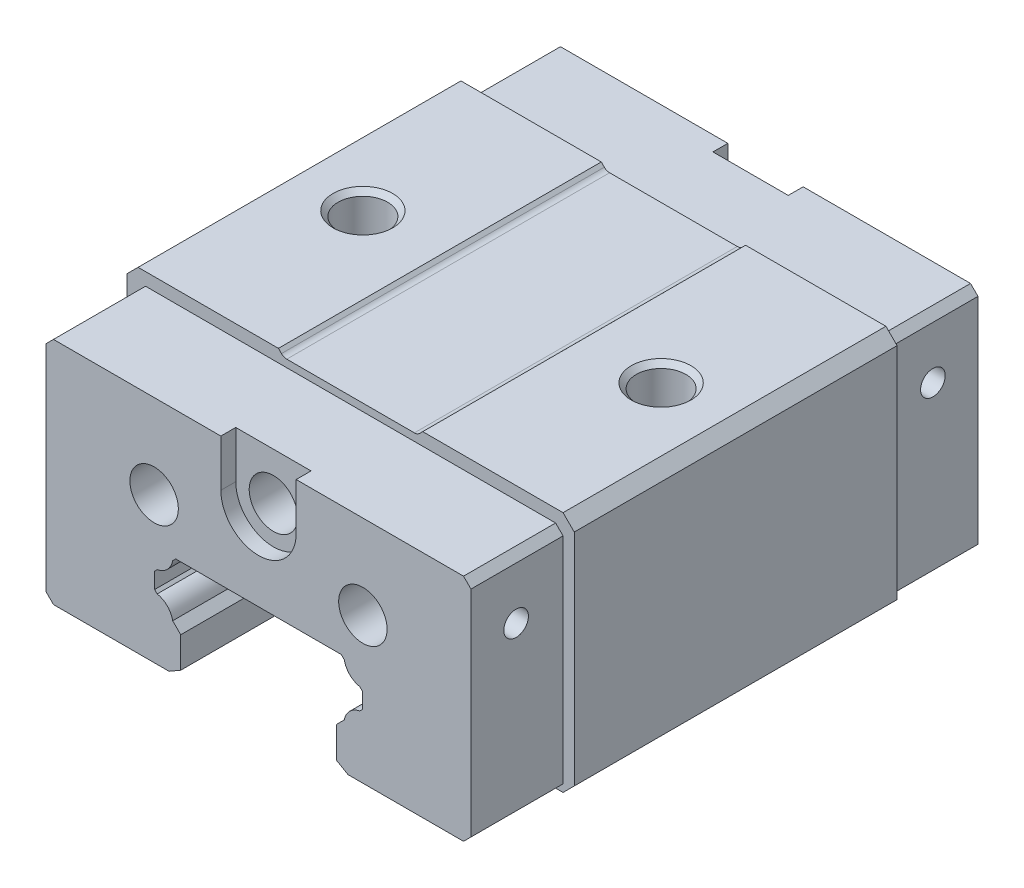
ISO-10303-21;
HEADER;
FILE_DESCRIPTION(('STEP AP214'),'2;1');
FILE_NAME('part.step','',(''),(''),'','','');
FILE_SCHEMA(('AUTOMOTIVE_DESIGN { 1 0 10303 214 1 1 1 1 }'));
ENDSEC;
DATA;
#1=APPLICATION_CONTEXT('core data for automotive mechanical design processes');
#2=APPLICATION_PROTOCOL_DEFINITION('international standard','automotive_design',2000,#1);
#3=PRODUCT_CONTEXT('',#1,'mechanical');
#4=PRODUCT('Part','Part','',(#3));
#5=PRODUCT_RELATED_PRODUCT_CATEGORY('part','',(#4));
#6=PRODUCT_DEFINITION_FORMATION('','',#4);
#7=PRODUCT_DEFINITION_CONTEXT('part definition',#1,'design');
#8=PRODUCT_DEFINITION('design','',#6,#7);
#9=PRODUCT_DEFINITION_SHAPE('','',#8);
#10=(LENGTH_UNIT() NAMED_UNIT(*) SI_UNIT(.MILLI.,.METRE.));
#11=(NAMED_UNIT(*) PLANE_ANGLE_UNIT() SI_UNIT($,.RADIAN.));
#12=(NAMED_UNIT(*) SI_UNIT($,.STERADIAN.) SOLID_ANGLE_UNIT());
#13=UNCERTAINTY_MEASURE_WITH_UNIT(LENGTH_MEASURE(1.E-05),#10,'distance_accuracy_value','');
#14=(GEOMETRIC_REPRESENTATION_CONTEXT(3) GLOBAL_UNCERTAINTY_ASSIGNED_CONTEXT((#13)) GLOBAL_UNIT_ASSIGNED_CONTEXT((#10,
#11,#12)) REPRESENTATION_CONTEXT('',''));
#15=CARTESIAN_POINT('',(0.,0.,0.));
#16=DIRECTION('',(0.,0.,1.));
#17=DIRECTION('',(1.,0.,0.));
#18=AXIS2_PLACEMENT_3D('',#15,#16,#17);
#19=CARTESIAN_POINT('',(-28.5,-32.5,-68.));
#20=DIRECTION('',(0.,0.,-1.));
#21=DIRECTION('',(0.,1.,0.));
#22=AXIS2_PLACEMENT_3D('',#19,#20,#21);
#23=PLANE('',#22);
#24=DIRECTION('',(0.,-1.,0.));
#25=VECTOR('',#24,1.);
#26=CARTESIAN_POINT('',(-5.05,-1.7000000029,-68.));
#27=LINE('',#26,#25);
#28=CARTESIAN_POINT('',(-5.05,-1.7000000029,-68.));
#29=VERTEX_POINT('',#28);
#30=CARTESIAN_POINT('',(-5.05,-8.,-68.));
#31=VERTEX_POINT('',#30);
#32=EDGE_CURVE('E405',#29,#31,#27,.T.);
#33=ORIENTED_EDGE('',*,*,#32,.T.);
#34=CARTESIAN_POINT('',(0.,-8.,-68.));
#35=DIRECTION('',(0.,0.,1.));
#36=DIRECTION('',(-1.,0.,0.));
#37=AXIS2_PLACEMENT_3D('',#34,#35,#36);
#38=CIRCLE('',#37,5.05);
#39=CARTESIAN_POINT('',(5.05,-8.,-68.));
#40=VERTEX_POINT('',#39);
#41=EDGE_CURVE('E393',#31,#40,#38,.T.);
#42=ORIENTED_EDGE('',*,*,#41,.T.);
#43=DIRECTION('',(0.,1.,0.));
#44=VECTOR('',#43,1.);
#45=CARTESIAN_POINT('',(5.05,-8.,-68.));
#46=LINE('',#45,#44);
#47=CARTESIAN_POINT('',(5.05,-1.7000000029,-68.));
#48=VERTEX_POINT('',#47);
#49=EDGE_CURVE('E404',#40,#48,#46,.T.);
#50=ORIENTED_EDGE('',*,*,#49,.T.);
#51=DIRECTION('',(1.,0.,0.));
#52=VECTOR('',#51,1.);
#53=CARTESIAN_POINT('',(5.05,-1.7000000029,-68.));
#54=LINE('',#53,#52);
#55=CARTESIAN_POINT('',(27.5,-1.7000000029,-68.));
#56=VERTEX_POINT('',#55);
#57=EDGE_CURVE('E426',#56,#48,#54,.F.);
#58=ORIENTED_EDGE('',*,*,#57,.F.);
#59=DIRECTION('',(0.707106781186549,-0.707106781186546,0.));
#60=VECTOR('',#59,1.);
#61=CARTESIAN_POINT('',(27.5,-1.7000000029,-68.));
#62=LINE('',#61,#60);
#63=CARTESIAN_POINT('',(28.5,-2.7000000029,-68.));
#64=VERTEX_POINT('',#63);
#65=EDGE_CURVE('E431',#64,#56,#62,.F.);
#66=ORIENTED_EDGE('',*,*,#65,.F.);
#67=DIRECTION('',(0.,-1.,0.));
#68=VECTOR('',#67,1.);
#69=CARTESIAN_POINT('',(28.5,-2.7000000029,-68.));
#70=LINE('',#69,#68);
#71=CARTESIAN_POINT('',(28.5,-31.5,-68.));
#72=VERTEX_POINT('',#71);
#73=EDGE_CURVE('E435',#72,#64,#70,.F.);
#74=ORIENTED_EDGE('',*,*,#73,.F.);
#75=DIRECTION('',(-0.707106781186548,-0.707106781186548,0.));
#76=VECTOR('',#75,1.);
#77=CARTESIAN_POINT('',(28.5,-31.5,-68.));
#78=LINE('',#77,#76);
#79=CARTESIAN_POINT('',(27.5,-32.5,-68.));
#80=VERTEX_POINT('',#79);
#81=EDGE_CURVE('E439',#80,#72,#78,.F.);
#82=ORIENTED_EDGE('',*,*,#81,.F.);
#83=DIRECTION('',(-1.,0.,0.));
#84=VECTOR('',#83,1.);
#85=CARTESIAN_POINT('',(27.5,-32.5,-68.));
#86=LINE('',#85,#84);
#87=CARTESIAN_POINT('',(12.0019237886,-32.5,-68.));
#88=VERTEX_POINT('',#87);
#89=EDGE_CURVE('E443',#88,#80,#86,.F.);
#90=ORIENTED_EDGE('',*,*,#89,.F.);
#91=DIRECTION('',(-0.866025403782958,0.500000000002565,0.));
#92=VECTOR('',#91,1.);
#93=CARTESIAN_POINT('',(12.0019237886,-32.5,-68.));
#94=LINE('',#93,#92);
#95=CARTESIAN_POINT('',(10.43,-31.5924493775,-68.));
#96=VERTEX_POINT('',#95);
#97=EDGE_CURVE('E448',#96,#88,#94,.F.);
#98=ORIENTED_EDGE('',*,*,#97,.F.);
#99=DIRECTION('',(0.,1.,0.));
#100=VECTOR('',#99,1.);
#101=CARTESIAN_POINT('',(10.43,-31.5924493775,-68.));
#102=LINE('',#101,#100);
#103=CARTESIAN_POINT('',(10.43,-27.4694469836,-68.));
#104=VERTEX_POINT('',#103);
#105=EDGE_CURVE('E452',#104,#96,#102,.F.);
#106=ORIENTED_EDGE('',*,*,#105,.F.);
#107=DIRECTION('',(0.707106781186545,0.70710678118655,0.));
#108=VECTOR('',#107,1.);
#109=CARTESIAN_POINT('',(10.43,-27.4694469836,-68.));
#110=LINE('',#109,#108);
#111=CARTESIAN_POINT('',(11.511772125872,-26.387674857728,-68.));
#112=VERTEX_POINT('',#111);
#113=EDGE_CURVE('E457',#112,#104,#110,.F.);
#114=ORIENTED_EDGE('',*,*,#113,.F.);
#115=CARTESIAN_POINT('',(14.0671741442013,-26.8671751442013,-68.));
#116=DIRECTION('',(0.,0.,-1.));
#117=DIRECTION('',(-0.982846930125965,0.184423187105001,0.));
#118=AXIS2_PLACEMENT_3D('',#115,#116,#117);
#119=CIRCLE('',#118,2.60000000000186);
#120=CARTESIAN_POINT('',(13.587673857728,-24.311773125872,-68.));
#121=VERTEX_POINT('',#120);
#122=EDGE_CURVE('E462',#121,#112,#119,.F.);
#123=ORIENTED_EDGE('',*,*,#122,.F.);
#124=DIRECTION('',(0.707106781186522,0.707106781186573,0.));
#125=VECTOR('',#124,1.);
#126=CARTESIAN_POINT('',(13.587673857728,-24.311773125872,-68.));
#127=LINE('',#126,#125);
#128=CARTESIAN_POINT('',(13.929999,-23.9694479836,-68.));
#129=VERTEX_POINT('',#128);
#130=EDGE_CURVE('E467',#129,#121,#127,.F.);
#131=ORIENTED_EDGE('',*,*,#130,.F.);
#132=DIRECTION('',(0.,1.,0.));
#133=VECTOR('',#132,1.);
#134=CARTESIAN_POINT('',(13.929999,-23.9694479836,-68.));
#135=LINE('',#134,#133);
#136=CARTESIAN_POINT('',(13.929999,-21.8305520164,-68.));
#137=VERTEX_POINT('',#136);
#138=EDGE_CURVE('E472',#137,#129,#135,.F.);
#139=ORIENTED_EDGE('',*,*,#138,.F.);
#140=DIRECTION('',(-0.70710678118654,0.707106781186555,0.));
#141=VECTOR('',#140,1.);
#142=CARTESIAN_POINT('',(13.929999,-21.8305520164,-68.));
#143=LINE('',#142,#141);
#144=CARTESIAN_POINT('',(13.587673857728,-21.488226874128,-68.));
#145=VERTEX_POINT('',#144);
#146=EDGE_CURVE('E477',#145,#137,#143,.F.);
#147=ORIENTED_EDGE('',*,*,#146,.F.);
#148=CARTESIAN_POINT('',(14.0671741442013,-18.9328248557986,-68.));
#149=DIRECTION('',(0.,0.,-1.));
#150=DIRECTION('',(-0.184423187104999,-0.982846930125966,0.));
#151=AXIS2_PLACEMENT_3D('',#148,#149,#150);
#152=CIRCLE('',#151,2.60000000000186);
#153=CARTESIAN_POINT('',(11.511772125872,-19.412325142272,-68.));
#154=VERTEX_POINT('',#153);
#155=EDGE_CURVE('E482',#154,#145,#152,.F.);
#156=ORIENTED_EDGE('',*,*,#155,.F.);
#157=DIRECTION('',(-0.707106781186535,0.70710678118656,0.));
#158=VECTOR('',#157,1.);
#159=CARTESIAN_POINT('',(11.511772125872,-19.412325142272,-68.));
#160=LINE('',#159,#158);
#161=CARTESIAN_POINT('',(11.0994469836,-19.,-68.));
#162=VERTEX_POINT('',#161);
#163=EDGE_CURVE('E487',#162,#154,#160,.F.);
#164=ORIENTED_EDGE('',*,*,#163,.F.);
#165=DIRECTION('',(-1.,0.,0.));
#166=VECTOR('',#165,1.);
#167=CARTESIAN_POINT('',(11.0994469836,-19.,-68.));
#168=LINE('',#167,#166);
#169=CARTESIAN_POINT('',(-11.0994469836,-19.,-68.));
#170=VERTEX_POINT('',#169);
#171=EDGE_CURVE('E492',#170,#162,#168,.F.);
#172=ORIENTED_EDGE('',*,*,#171,.F.);
#173=DIRECTION('',(-0.707106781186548,-0.707106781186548,0.));
#174=VECTOR('',#173,1.);
#175=CARTESIAN_POINT('',(-11.0994469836,-19.,-68.));
#176=LINE('',#175,#174);
#177=CARTESIAN_POINT('',(-11.511772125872,-19.412325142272,-68.));
#178=VERTEX_POINT('',#177);
#179=EDGE_CURVE('E497',#178,#170,#176,.F.);
#180=ORIENTED_EDGE('',*,*,#179,.F.);
#181=CARTESIAN_POINT('',(-14.0671741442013,-18.9328248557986,-68.));
#182=DIRECTION('',(0.,0.,-1.));
#183=DIRECTION('',(0.982846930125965,-0.184423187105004,0.));
#184=AXIS2_PLACEMENT_3D('',#181,#182,#183);
#185=CIRCLE('',#184,2.60000000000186);
#186=CARTESIAN_POINT('',(-13.587673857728,-21.488226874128,-68.));
#187=VERTEX_POINT('',#186);
#188=EDGE_CURVE('E502',#187,#178,#185,.F.);
#189=ORIENTED_EDGE('',*,*,#188,.F.);
#190=DIRECTION('',(-0.707106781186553,-0.707106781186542,0.));
#191=VECTOR('',#190,1.);
#192=CARTESIAN_POINT('',(-13.587673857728,-21.488226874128,-68.));
#193=LINE('',#192,#191);
#194=CARTESIAN_POINT('',(-13.929999,-21.8305520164,-68.));
#195=VERTEX_POINT('',#194);
#196=EDGE_CURVE('E507',#195,#187,#193,.F.);
#197=ORIENTED_EDGE('',*,*,#196,.F.);
#198=DIRECTION('',(0.,-1.,0.));
#199=VECTOR('',#198,1.);
#200=CARTESIAN_POINT('',(-13.929999,-21.8305520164,-68.));
#201=LINE('',#200,#199);
#202=CARTESIAN_POINT('',(-13.929999,-23.9694479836,-68.));
#203=VERTEX_POINT('',#202);
#204=EDGE_CURVE('E512',#203,#195,#201,.F.);
#205=ORIENTED_EDGE('',*,*,#204,.F.);
#206=DIRECTION('',(0.707106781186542,-0.707106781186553,0.));
#207=VECTOR('',#206,1.);
#208=CARTESIAN_POINT('',(-13.929999,-23.9694479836,-68.));
#209=LINE('',#208,#207);
#210=CARTESIAN_POINT('',(-13.587673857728,-24.311773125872,-68.));
#211=VERTEX_POINT('',#210);
#212=EDGE_CURVE('E517',#211,#203,#209,.F.);
#213=ORIENTED_EDGE('',*,*,#212,.F.);
#214=CARTESIAN_POINT('',(-14.0671741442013,-26.8671751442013,-68.));
#215=DIRECTION('',(0.,0.,-1.));
#216=DIRECTION('',(0.184423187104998,0.982846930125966,0.));
#217=AXIS2_PLACEMENT_3D('',#214,#215,#216);
#218=CIRCLE('',#217,2.60000000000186);
#219=CARTESIAN_POINT('',(-11.511772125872,-26.387674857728,-68.));
#220=VERTEX_POINT('',#219);
#221=EDGE_CURVE('E522',#220,#211,#218,.F.);
#222=ORIENTED_EDGE('',*,*,#221,.F.);
#223=DIRECTION('',(0.707106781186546,-0.707106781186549,0.));
#224=VECTOR('',#223,1.);
#225=CARTESIAN_POINT('',(-11.511772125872,-26.387674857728,-68.));
#226=LINE('',#225,#224);
#227=CARTESIAN_POINT('',(-10.43,-27.4694469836,-68.));
#228=VERTEX_POINT('',#227);
#229=EDGE_CURVE('E527',#228,#220,#226,.F.);
#230=ORIENTED_EDGE('',*,*,#229,.F.);
#231=DIRECTION('',(0.,-1.,0.));
#232=VECTOR('',#231,1.);
#233=CARTESIAN_POINT('',(-10.43,-27.4694469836,-68.));
#234=LINE('',#233,#232);
#235=CARTESIAN_POINT('',(-10.43,-31.5924493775,-68.));
#236=VERTEX_POINT('',#235);
#237=EDGE_CURVE('E532',#236,#228,#234,.F.);
#238=ORIENTED_EDGE('',*,*,#237,.F.);
#239=DIRECTION('',(-0.866025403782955,-0.500000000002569,0.));
#240=VECTOR('',#239,1.);
#241=CARTESIAN_POINT('',(-10.43,-31.5924493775,-68.));
#242=LINE('',#241,#240);
#243=CARTESIAN_POINT('',(-12.0019237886,-32.5,-68.));
#244=VERTEX_POINT('',#243);
#245=EDGE_CURVE('E537',#244,#236,#242,.F.);
#246=ORIENTED_EDGE('',*,*,#245,.F.);
#247=DIRECTION('',(-1.,0.,0.));
#248=VECTOR('',#247,1.);
#249=CARTESIAN_POINT('',(-12.0019237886,-32.5,-68.));
#250=LINE('',#249,#248);
#251=CARTESIAN_POINT('',(-27.5,-32.5,-68.));
#252=VERTEX_POINT('',#251);
#253=EDGE_CURVE('E542',#252,#244,#250,.F.);
#254=ORIENTED_EDGE('',*,*,#253,.F.);
#255=DIRECTION('',(-0.707106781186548,0.707106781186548,0.));
#256=VECTOR('',#255,1.);
#257=CARTESIAN_POINT('',(-27.5,-32.5,-68.));
#258=LINE('',#257,#256);
#259=CARTESIAN_POINT('',(-28.5,-31.5,-68.));
#260=VERTEX_POINT('',#259);
#261=EDGE_CURVE('E547',#260,#252,#258,.F.);
#262=ORIENTED_EDGE('',*,*,#261,.F.);
#263=DIRECTION('',(0.,1.,0.));
#264=VECTOR('',#263,1.);
#265=CARTESIAN_POINT('',(-28.5,-31.5,-68.));
#266=LINE('',#265,#264);
#267=CARTESIAN_POINT('',(-28.5,-2.7000000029,-68.));
#268=VERTEX_POINT('',#267);
#269=EDGE_CURVE('E551',#268,#260,#266,.F.);
#270=ORIENTED_EDGE('',*,*,#269,.F.);
#271=DIRECTION('',(0.707106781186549,0.707106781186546,0.));
#272=VECTOR('',#271,1.);
#273=CARTESIAN_POINT('',(-28.5,-2.7000000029,-68.));
#274=LINE('',#273,#272);
#275=CARTESIAN_POINT('',(-27.5,-1.7000000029,-68.));
#276=VERTEX_POINT('',#275);
#277=EDGE_CURVE('E555',#276,#268,#274,.F.);
#278=ORIENTED_EDGE('',*,*,#277,.F.);
#279=DIRECTION('',(1.,0.,0.));
#280=VECTOR('',#279,1.);
#281=CARTESIAN_POINT('',(-27.5,-1.7000000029,-68.));
#282=LINE('',#281,#280);
#283=EDGE_CURVE('E418',#29,#276,#282,.F.);
#284=ORIENTED_EDGE('',*,*,#283,.F.);
#285=EDGE_LOOP('',(#33,#42,#50,#58,#66,#74,#82,#90,#98,#106,#114,#123,#131,#139,#147,#156,#164,
#172,#180,#189,#197,#205,#213,#222,#230,#238,#246,#254,#262,#270,#278,#284));
#286=FACE_BOUND('',#285,.T.);
#287=CARTESIAN_POINT('',(-14.,-13.,-68.));
#288=DIRECTION('',(0.,0.,1.));
#289=DIRECTION('',(-1.,0.,0.));
#290=AXIS2_PLACEMENT_3D('',#287,#288,#289);
#291=CIRCLE('',#290,3.25);
#292=CARTESIAN_POINT('',(-17.25,-13.,-68.));
#293=VERTEX_POINT('',#292);
#294=EDGE_CURVE('E563',#293,#293,#291,.T.);
#295=ORIENTED_EDGE('',*,*,#294,.T.);
#296=EDGE_LOOP('',(#295));
#297=FACE_BOUND('',#296,.T.);
#298=CARTESIAN_POINT('',(14.,-13.,-68.));
#299=DIRECTION('',(0.,0.,1.));
#300=DIRECTION('',(-0.99999999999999,-1.42053894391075E-07,0.));
#301=AXIS2_PLACEMENT_3D('',#298,#299,#300);
#302=CIRCLE('',#301,3.25);
#303=CARTESIAN_POINT('',(10.75,-13.0000004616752,-68.));
#304=VERTEX_POINT('',#303);
#305=EDGE_CURVE('E568',#304,#304,#302,.T.);
#306=ORIENTED_EDGE('',*,*,#305,.T.);
#307=EDGE_LOOP('',(#306));
#308=FACE_BOUND('',#307,.T.);
#309=ADVANCED_FACE('F17',(#286,#297,#308),#23,.T.);
#310=CARTESIAN_POINT('',(-27.5,-1.7000000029,-55.65));
#311=DIRECTION('',(0.,1.,0.));
#312=DIRECTION('',(1.,0.,0.));
#313=AXIS2_PLACEMENT_3D('',#310,#311,#312);
#314=PLANE('',#313);
#315=DIRECTION('',(0.,0.,-1.));
#316=VECTOR('',#315,1.);
#317=CARTESIAN_POINT('',(-5.05,-1.7000000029,-66.));
#318=LINE('',#317,#316);
#319=CARTESIAN_POINT('',(-5.05,-1.7000000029,-66.));
#320=VERTEX_POINT('',#319);
#321=EDGE_CURVE('E571',#29,#320,#318,.F.);
#322=ORIENTED_EDGE('',*,*,#321,.F.);
#323=ORIENTED_EDGE('',*,*,#283,.T.);
#324=DIRECTION('',(0.,0.,1.));
#325=VECTOR('',#324,1.);
#326=CARTESIAN_POINT('',(-27.5,-1.7000000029,-68.));
#327=LINE('',#326,#325);
#328=CARTESIAN_POINT('',(-27.5,-1.7000000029,-55.65));
#329=VERTEX_POINT('',#328);
#330=EDGE_CURVE('E573',#329,#276,#327,.F.);
#331=ORIENTED_EDGE('',*,*,#330,.F.);
#332=DIRECTION('',(1.,0.,0.));
#333=VECTOR('',#332,1.);
#334=CARTESIAN_POINT('',(-27.5,-1.7000000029,-55.65));
#335=LINE('',#334,#333);
#336=CARTESIAN_POINT('',(27.5,-1.7000000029,-55.65));
#337=VERTEX_POINT('',#336);
#338=EDGE_CURVE('E577',#337,#329,#335,.F.);
#339=ORIENTED_EDGE('',*,*,#338,.F.);
#340=DIRECTION('',(0.,0.,-1.));
#341=VECTOR('',#340,1.);
#342=CARTESIAN_POINT('',(27.5,-1.7000000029,-55.65));
#343=LINE('',#342,#341);
#344=EDGE_CURVE('E581',#337,#56,#343,.T.);
#345=ORIENTED_EDGE('',*,*,#344,.T.);
#346=ORIENTED_EDGE('',*,*,#57,.T.);
#347=DIRECTION('',(0.,0.,1.));
#348=VECTOR('',#347,1.);
#349=CARTESIAN_POINT('',(5.05,-1.7000000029,-68.));
#350=LINE('',#349,#348);
#351=CARTESIAN_POINT('',(5.05,-1.7000000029,-66.));
#352=VERTEX_POINT('',#351);
#353=EDGE_CURVE('E586',#352,#48,#350,.F.);
#354=ORIENTED_EDGE('',*,*,#353,.F.);
#355=DIRECTION('',(-1.,0.,0.));
#356=VECTOR('',#355,1.);
#357=CARTESIAN_POINT('',(5.05,-1.7000000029,-66.));
#358=LINE('',#357,#356);
#359=EDGE_CURVE('E590',#352,#320,#358,.T.);
#360=ORIENTED_EDGE('',*,*,#359,.T.);
#361=EDGE_LOOP('',(#322,#323,#331,#339,#345,#346,#354,#360));
#362=FACE_BOUND('',#361,.T.);
#363=ADVANCED_FACE('F1347',(#362),#314,.T.);
#364=CARTESIAN_POINT('',(-30.,-8.,-55.65));
#365=DIRECTION('',(-1.,0.,0.));
#366=DIRECTION('',(0.,0.,1.));
#367=AXIS2_PLACEMENT_3D('',#364,#365,#366);
#368=PLANE('',#367);
#369=DIRECTION('',(0.,-1.,0.));
#370=VECTOR('',#369,1.);
#371=CARTESIAN_POINT('',(-30.,-1.5,-55.65));
#372=LINE('',#371,#370);
#373=CARTESIAN_POINT('',(-30.,-8.,-55.65));
#374=VERTEX_POINT('',#373);
#375=CARTESIAN_POINT('',(-30.,-1.5,-55.65));
#376=VERTEX_POINT('',#375);
#377=EDGE_CURVE('E595',#374,#376,#372,.F.);
#378=ORIENTED_EDGE('',*,*,#377,.F.);
#379=DIRECTION('',(0.,0.,1.));
#380=VECTOR('',#379,1.);
#381=CARTESIAN_POINT('',(-30.,-8.,-55.65));
#382=LINE('',#381,#380);
#383=CARTESIAN_POINT('',(-30.,-8.,-12.35));
#384=VERTEX_POINT('',#383);
#385=EDGE_CURVE('E599',#374,#384,#382,.T.);
#386=ORIENTED_EDGE('',*,*,#385,.T.);
#387=DIRECTION('',(0.,1.,0.));
#388=VECTOR('',#387,1.);
#389=CARTESIAN_POINT('',(-30.,-8.,-12.35));
#390=LINE('',#389,#388);
#391=CARTESIAN_POINT('',(-30.,-1.5,-12.35));
#392=VERTEX_POINT('',#391);
#393=EDGE_CURVE('E604',#384,#392,#390,.T.);
#394=ORIENTED_EDGE('',*,*,#393,.T.);
#395=DIRECTION('',(0.,0.,-1.));
#396=VECTOR('',#395,1.);
#397=CARTESIAN_POINT('',(-30.,-1.5,-12.35));
#398=LINE('',#397,#396);
#399=EDGE_CURVE('E609',#376,#392,#398,.F.);
#400=ORIENTED_EDGE('',*,*,#399,.F.);
#401=EDGE_LOOP('',(#378,#386,#394,#400));
#402=FACE_BOUND('',#401,.T.);
#403=ADVANCED_FACE('F1352',(#402),#368,.T.);
#404=CARTESIAN_POINT('',(-30.,-8.,-55.65));
#405=DIRECTION('',(-0.707106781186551,-0.707106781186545,0.));
#406=DIRECTION('',(0.707106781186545,-0.707106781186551,0.));
#407=AXIS2_PLACEMENT_3D('',#404,#405,#406);
#408=PLANE('',#407);
#409=DIRECTION('',(0.707106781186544,-0.707106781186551,0.));
#410=VECTOR('',#409,1.);
#411=CARTESIAN_POINT('',(-30.,-8.,-55.65));
#412=LINE('',#411,#410);
#413=CARTESIAN_POINT('',(-29.6,-8.4,-55.65));
#414=VERTEX_POINT('',#413);
#415=EDGE_CURVE('E614',#414,#374,#412,.F.);
#416=ORIENTED_EDGE('',*,*,#415,.F.);
#417=DIRECTION('',(0.,0.,1.));
#418=VECTOR('',#417,1.);
#419=CARTESIAN_POINT('',(-29.6,-8.4,-55.65));
#420=LINE('',#419,#418);
#421=CARTESIAN_POINT('',(-29.6,-8.4,-12.35));
#422=VERTEX_POINT('',#421);
#423=EDGE_CURVE('E618',#414,#422,#420,.T.);
#424=ORIENTED_EDGE('',*,*,#423,.T.);
#425=DIRECTION('',(-0.707106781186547,0.707106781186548,0.));
#426=VECTOR('',#425,1.);
#427=CARTESIAN_POINT('',(-29.6,-8.4,-12.35));
#428=LINE('',#427,#426);
#429=EDGE_CURVE('E623',#422,#384,#428,.T.);
#430=ORIENTED_EDGE('',*,*,#429,.T.);
#431=ORIENTED_EDGE('',*,*,#385,.F.);
#432=EDGE_LOOP('',(#416,#424,#430,#431));
#433=FACE_BOUND('',#432,.T.);
#434=ADVANCED_FACE('F1358',(#433),#408,.T.);
#435=CARTESIAN_POINT('',(-29.6,-31.4,-55.65));
#436=DIRECTION('',(-1.,0.,0.));
#437=DIRECTION('',(0.,0.,1.));
#438=AXIS2_PLACEMENT_3D('',#435,#436,#437);
#439=PLANE('',#438);
#440=DIRECTION('',(0.,-1.,0.));
#441=VECTOR('',#440,1.);
#442=CARTESIAN_POINT('',(-29.6,-8.4,-55.65));
#443=LINE('',#442,#441);
#444=CARTESIAN_POINT('',(-29.6,-31.4,-55.65));
#445=VERTEX_POINT('',#444);
#446=EDGE_CURVE('E628',#445,#414,#443,.F.);
#447=ORIENTED_EDGE('',*,*,#446,.F.);
#448=DIRECTION('',(0.,0.,1.));
#449=VECTOR('',#448,1.);
#450=CARTESIAN_POINT('',(-29.6,-31.4,-55.65));
#451=LINE('',#450,#449);
#452=CARTESIAN_POINT('',(-29.6,-31.4,-12.35));
#453=VERTEX_POINT('',#452);
#454=EDGE_CURVE('E632',#445,#453,#451,.T.);
#455=ORIENTED_EDGE('',*,*,#454,.T.);
#456=DIRECTION('',(0.,1.,0.));
#457=VECTOR('',#456,1.);
#458=CARTESIAN_POINT('',(-29.6,-31.4,-12.35));
#459=LINE('',#458,#457);
#460=EDGE_CURVE('E637',#453,#422,#459,.T.);
#461=ORIENTED_EDGE('',*,*,#460,.T.);
#462=ORIENTED_EDGE('',*,*,#423,.F.);
#463=EDGE_LOOP('',(#447,#455,#461,#462));
#464=FACE_BOUND('',#463,.T.);
#465=ADVANCED_FACE('F1362',(#464),#439,.T.);
#466=CARTESIAN_POINT('',(-29.6,-31.4,-55.65));
#467=DIRECTION('',(-0.707106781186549,-0.707106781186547,0.));
#468=DIRECTION('',(0.707106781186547,-0.707106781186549,0.));
#469=AXIS2_PLACEMENT_3D('',#466,#467,#468);
#470=PLANE('',#469);
#471=DIRECTION('',(0.707106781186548,-0.707106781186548,0.));
#472=VECTOR('',#471,1.);
#473=CARTESIAN_POINT('',(-29.6,-31.4,-55.65));
#474=LINE('',#473,#472);
#475=CARTESIAN_POINT('',(-28.5,-32.5,-55.65));
#476=VERTEX_POINT('',#475);
#477=EDGE_CURVE('E642',#476,#445,#474,.F.);
#478=ORIENTED_EDGE('',*,*,#477,.F.);
#479=DIRECTION('',(0.,0.,1.));
#480=VECTOR('',#479,1.);
#481=CARTESIAN_POINT('',(-28.5,-32.5,-55.65));
#482=LINE('',#481,#480);
#483=CARTESIAN_POINT('',(-28.5,-32.5,-12.35));
#484=VERTEX_POINT('',#483);
#485=EDGE_CURVE('E646',#476,#484,#482,.T.);
#486=ORIENTED_EDGE('',*,*,#485,.T.);
#487=DIRECTION('',(-0.707106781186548,0.707106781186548,0.));
#488=VECTOR('',#487,1.);
#489=CARTESIAN_POINT('',(-28.5,-32.5,-12.35));
#490=LINE('',#489,#488);
#491=EDGE_CURVE('E651',#484,#453,#490,.T.);
#492=ORIENTED_EDGE('',*,*,#491,.T.);
#493=ORIENTED_EDGE('',*,*,#454,.F.);
#494=EDGE_LOOP('',(#478,#486,#492,#493));
#495=FACE_BOUND('',#494,.T.);
#496=ADVANCED_FACE('F1366',(#495),#470,.T.);
#497=CARTESIAN_POINT('',(-28.5,-32.5,0.));
#498=DIRECTION('',(0.,-1.,0.));
#499=DIRECTION('',(0.,0.,-1.));
#500=AXIS2_PLACEMENT_3D('',#497,#498,#499);
#501=PLANE('',#500);
#502=DIRECTION('',(1.,0.,0.));
#503=VECTOR('',#502,1.);
#504=CARTESIAN_POINT('',(-28.5,-32.5,-55.65));
#505=LINE('',#504,#503);
#506=CARTESIAN_POINT('',(-27.5,-32.5,-55.65));
#507=VERTEX_POINT('',#506);
#508=EDGE_CURVE('E656',#507,#476,#505,.F.);
#509=ORIENTED_EDGE('',*,*,#508,.F.);
#510=DIRECTION('',(0.,0.,-1.));
#511=VECTOR('',#510,1.);
#512=CARTESIAN_POINT('',(-27.5,-32.5,-55.65));
#513=LINE('',#512,#511);
#514=EDGE_CURVE('E660',#507,#252,#513,.T.);
#515=ORIENTED_EDGE('',*,*,#514,.T.);
#516=ORIENTED_EDGE('',*,*,#253,.T.);
#517=DIRECTION('',(0.,0.,1.));
#518=VECTOR('',#517,1.);
#519=CARTESIAN_POINT('',(-12.0019237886,-32.5,-68.));
#520=LINE('',#519,#518);
#521=CARTESIAN_POINT('',(-12.0019237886,-32.5,0.));
#522=VERTEX_POINT('',#521);
#523=EDGE_CURVE('E665',#244,#522,#520,.T.);
#524=ORIENTED_EDGE('',*,*,#523,.T.);
#525=DIRECTION('',(-1.,0.,0.));
#526=VECTOR('',#525,1.);
#527=CARTESIAN_POINT('',(-12.0019237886,-32.5,0.));
#528=LINE('',#527,#526);
#529=CARTESIAN_POINT('',(-27.5,-32.5,0.));
#530=VERTEX_POINT('',#529);
#531=EDGE_CURVE('E670',#530,#522,#528,.F.);
#532=ORIENTED_EDGE('',*,*,#531,.F.);
#533=DIRECTION('',(0.,0.,-1.));
#534=VECTOR('',#533,1.);
#535=CARTESIAN_POINT('',(-27.5,-32.5,0.));
#536=LINE('',#535,#534);
#537=CARTESIAN_POINT('',(-27.5,-32.5,-12.35));
#538=VERTEX_POINT('',#537);
#539=EDGE_CURVE('E675',#538,#530,#536,.F.);
#540=ORIENTED_EDGE('',*,*,#539,.F.);
#541=DIRECTION('',(-1.,0.,0.));
#542=VECTOR('',#541,1.);
#543=CARTESIAN_POINT('',(-27.5,-32.5,-12.35));
#544=LINE('',#543,#542);
#545=EDGE_CURVE('E679',#538,#484,#544,.T.);
#546=ORIENTED_EDGE('',*,*,#545,.T.);
#547=ORIENTED_EDGE('',*,*,#485,.F.);
#548=EDGE_LOOP('',(#509,#515,#516,#524,#532,#540,#546,#547));
#549=FACE_BOUND('',#548,.T.);
#550=ADVANCED_FACE('F1370',(#549),#501,.T.);
#551=CARTESIAN_POINT('',(12.0019237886,-32.5,0.));
#552=DIRECTION('',(0.,-1.,0.));
#553=DIRECTION('',(0.,0.,-1.));
#554=AXIS2_PLACEMENT_3D('',#551,#552,#553);
#555=PLANE('',#554);
#556=DIRECTION('',(1.,0.,0.));
#557=VECTOR('',#556,1.);
#558=CARTESIAN_POINT('',(27.5,-32.5,-55.65));
#559=LINE('',#558,#557);
#560=CARTESIAN_POINT('',(28.5,-32.5,-55.65));
#561=VERTEX_POINT('',#560);
#562=CARTESIAN_POINT('',(27.5,-32.5,-55.65));
#563=VERTEX_POINT('',#562);
#564=EDGE_CURVE('E684',#561,#563,#559,.F.);
#565=ORIENTED_EDGE('',*,*,#564,.F.);
#566=DIRECTION('',(0.,0.,1.));
#567=VECTOR('',#566,1.);
#568=CARTESIAN_POINT('',(28.5,-32.5,-55.65));
#569=LINE('',#568,#567);
#570=CARTESIAN_POINT('',(28.5,-32.5,-12.35));
#571=VERTEX_POINT('',#570);
#572=EDGE_CURVE('E688',#561,#571,#569,.T.);
#573=ORIENTED_EDGE('',*,*,#572,.T.);
#574=DIRECTION('',(-1.,0.,0.));
#575=VECTOR('',#574,1.);
#576=CARTESIAN_POINT('',(28.5,-32.5,-12.35));
#577=LINE('',#576,#575);
#578=CARTESIAN_POINT('',(27.5,-32.5,-12.35));
#579=VERTEX_POINT('',#578);
#580=EDGE_CURVE('E693',#571,#579,#577,.T.);
#581=ORIENTED_EDGE('',*,*,#580,.T.);
#582=DIRECTION('',(0.,0.,1.));
#583=VECTOR('',#582,1.);
#584=CARTESIAN_POINT('',(27.5,-32.5,-12.35));
#585=LINE('',#584,#583);
#586=CARTESIAN_POINT('',(27.5,-32.5,0.));
#587=VERTEX_POINT('',#586);
#588=EDGE_CURVE('E698',#579,#587,#585,.T.);
#589=ORIENTED_EDGE('',*,*,#588,.T.);
#590=DIRECTION('',(-1.,0.,0.));
#591=VECTOR('',#590,1.);
#592=CARTESIAN_POINT('',(27.5,-32.5,0.));
#593=LINE('',#592,#591);
#594=CARTESIAN_POINT('',(12.0019237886,-32.5,0.));
#595=VERTEX_POINT('',#594);
#596=EDGE_CURVE('E703',#595,#587,#593,.F.);
#597=ORIENTED_EDGE('',*,*,#596,.F.);
#598=DIRECTION('',(0.,0.,-1.));
#599=VECTOR('',#598,1.);
#600=CARTESIAN_POINT('',(12.0019237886,-32.5,0.));
#601=LINE('',#600,#599);
#602=EDGE_CURVE('E708',#88,#595,#601,.F.);
#603=ORIENTED_EDGE('',*,*,#602,.F.);
#604=ORIENTED_EDGE('',*,*,#89,.T.);
#605=DIRECTION('',(0.,0.,1.));
#606=VECTOR('',#605,1.);
#607=CARTESIAN_POINT('',(27.5,-32.5,-68.));
#608=LINE('',#607,#606);
#609=EDGE_CURVE('E712',#563,#80,#608,.F.);
#610=ORIENTED_EDGE('',*,*,#609,.F.);
#611=EDGE_LOOP('',(#565,#573,#581,#589,#597,#603,#604,#610));
#612=FACE_BOUND('',#611,.T.);
#613=ADVANCED_FACE('F1374',(#612),#555,.T.);
#614=CARTESIAN_POINT('',(28.5,-32.5,-55.65));
#615=DIRECTION('',(0.707106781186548,-0.707106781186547,0.));
#616=DIRECTION('',(0.707106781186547,0.707106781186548,0.));
#617=AXIS2_PLACEMENT_3D('',#614,#615,#616);
#618=PLANE('',#617);
#619=DIRECTION('',(0.707106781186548,0.707106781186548,0.));
#620=VECTOR('',#619,1.);
#621=CARTESIAN_POINT('',(28.5,-32.5,-55.65));
#622=LINE('',#621,#620);
#623=CARTESIAN_POINT('',(30.,-31.,-55.65));
#624=VERTEX_POINT('',#623);
#625=EDGE_CURVE('E716',#624,#561,#622,.F.);
#626=ORIENTED_EDGE('',*,*,#625,.F.);
#627=DIRECTION('',(0.,0.,1.));
#628=VECTOR('',#627,1.);
#629=CARTESIAN_POINT('',(30.,-31.,-55.65));
#630=LINE('',#629,#628);
#631=CARTESIAN_POINT('',(30.,-31.,-12.35));
#632=VERTEX_POINT('',#631);
#633=EDGE_CURVE('E720',#624,#632,#630,.T.);
#634=ORIENTED_EDGE('',*,*,#633,.T.);
#635=DIRECTION('',(-0.707106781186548,-0.707106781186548,0.));
#636=VECTOR('',#635,1.);
#637=CARTESIAN_POINT('',(30.,-31.,-12.35));
#638=LINE('',#637,#636);
#639=EDGE_CURVE('E725',#632,#571,#638,.T.);
#640=ORIENTED_EDGE('',*,*,#639,.T.);
#641=ORIENTED_EDGE('',*,*,#572,.F.);
#642=EDGE_LOOP('',(#626,#634,#640,#641));
#643=FACE_BOUND('',#642,.T.);
#644=ADVANCED_FACE('F1378',(#643),#618,.T.);
#645=CARTESIAN_POINT('',(30.,-31.,-12.35));
#646=DIRECTION('',(1.,0.,0.));
#647=DIRECTION('',(0.,0.,-1.));
#648=AXIS2_PLACEMENT_3D('',#645,#646,#647);
#649=PLANE('',#648);
#650=DIRECTION('',(0.,1.,0.));
#651=VECTOR('',#650,1.);
#652=CARTESIAN_POINT('',(30.,-31.,-55.65));
#653=LINE('',#652,#651);
#654=CARTESIAN_POINT('',(30.,-1.5,-55.65));
#655=VERTEX_POINT('',#654);
#656=EDGE_CURVE('E730',#655,#624,#653,.F.);
#657=ORIENTED_EDGE('',*,*,#656,.F.);
#658=DIRECTION('',(0.,0.,1.));
#659=VECTOR('',#658,1.);
#660=CARTESIAN_POINT('',(30.,-1.5,-55.65));
#661=LINE('',#660,#659);
#662=CARTESIAN_POINT('',(30.,-1.5,-12.35));
#663=VERTEX_POINT('',#662);
#664=EDGE_CURVE('E734',#655,#663,#661,.T.);
#665=ORIENTED_EDGE('',*,*,#664,.T.);
#666=DIRECTION('',(0.,-1.,0.));
#667=VECTOR('',#666,1.);
#668=CARTESIAN_POINT('',(30.,-1.5,-12.35));
#669=LINE('',#668,#667);
#670=EDGE_CURVE('E739',#663,#632,#669,.T.);
#671=ORIENTED_EDGE('',*,*,#670,.T.);
#672=ORIENTED_EDGE('',*,*,#633,.F.);
#673=EDGE_LOOP('',(#657,#665,#671,#672));
#674=FACE_BOUND('',#673,.T.);
#675=ADVANCED_FACE('F1382',(#674),#649,.T.);
#676=CARTESIAN_POINT('',(30.,-1.5,-55.65));
#677=DIRECTION('',(0.707106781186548,0.707106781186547,0.));
#678=DIRECTION('',(-0.707106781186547,0.707106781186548,0.));
#679=AXIS2_PLACEMENT_3D('',#676,#677,#678);
#680=PLANE('',#679);
#681=DIRECTION('',(-0.707106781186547,0.707106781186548,0.));
#682=VECTOR('',#681,1.);
#683=CARTESIAN_POINT('',(30.,-1.5,-55.65));
#684=LINE('',#683,#682);
#685=CARTESIAN_POINT('',(28.5,0.,-55.65));
#686=VERTEX_POINT('',#685);
#687=EDGE_CURVE('E744',#686,#655,#684,.F.);
#688=ORIENTED_EDGE('',*,*,#687,.F.);
#689=DIRECTION('',(0.,0.,1.));
#690=VECTOR('',#689,1.);
#691=CARTESIAN_POINT('',(28.5,0.,-55.65));
#692=LINE('',#691,#690);
#693=CARTESIAN_POINT('',(28.5,0.,-12.35));
#694=VERTEX_POINT('',#693);
#695=EDGE_CURVE('E748',#686,#694,#692,.T.);
#696=ORIENTED_EDGE('',*,*,#695,.T.);
#697=DIRECTION('',(0.707106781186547,-0.707106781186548,0.));
#698=VECTOR('',#697,1.);
#699=CARTESIAN_POINT('',(28.5,0.,-12.35));
#700=LINE('',#699,#698);
#701=EDGE_CURVE('E753',#694,#663,#700,.T.);
#702=ORIENTED_EDGE('',*,*,#701,.T.);
#703=ORIENTED_EDGE('',*,*,#664,.F.);
#704=EDGE_LOOP('',(#688,#696,#702,#703));
#705=FACE_BOUND('',#704,.T.);
#706=ADVANCED_FACE('F1386',(#705),#680,.T.);
#707=CARTESIAN_POINT('',(9.6757359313,0.,-55.65));
#708=DIRECTION('',(0.,1.,0.));
#709=DIRECTION('',(0.,0.,1.));
#710=AXIS2_PLACEMENT_3D('',#707,#708,#709);
#711=PLANE('',#710);
#712=DIRECTION('',(-1.,0.,0.));
#713=VECTOR('',#712,1.);
#714=CARTESIAN_POINT('',(28.5,0.,-55.65));
#715=LINE('',#714,#713);
#716=CARTESIAN_POINT('',(9.6757359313,0.,-55.65));
#717=VERTEX_POINT('',#716);
#718=EDGE_CURVE('E758',#717,#686,#715,.F.);
#719=ORIENTED_EDGE('',*,*,#718,.F.);
#720=DIRECTION('',(0.,0.,1.));
#721=VECTOR('',#720,1.);
#722=CARTESIAN_POINT('',(9.6757359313,0.,-55.65));
#723=LINE('',#722,#721);
#724=CARTESIAN_POINT('',(9.6757359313,0.,-12.35));
#725=VERTEX_POINT('',#724);
#726=EDGE_CURVE('E762',#717,#725,#723,.T.);
#727=ORIENTED_EDGE('',*,*,#726,.T.);
#728=DIRECTION('',(1.,0.,0.));
#729=VECTOR('',#728,1.);
#730=CARTESIAN_POINT('',(9.6757359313,0.,-12.35));
#731=LINE('',#730,#729);
#732=EDGE_CURVE('E767',#725,#694,#731,.T.);
#733=ORIENTED_EDGE('',*,*,#732,.T.);
#734=ORIENTED_EDGE('',*,*,#695,.F.);
#735=EDGE_LOOP('',(#719,#727,#733,#734));
#736=FACE_BOUND('',#735,.T.);
#737=CARTESIAN_POINT('',(20.,0.,-34.));
#738=DIRECTION('',(0.,-1.,0.));
#739=DIRECTION('',(0.,0.,1.));
#740=AXIS2_PLACEMENT_3D('',#737,#738,#739);
#741=CIRCLE('',#740,4.);
#742=CARTESIAN_POINT('',(20.,0.,-30.));
#743=VERTEX_POINT('',#742);
#744=EDGE_CURVE('E772',#743,#743,#741,.T.);
#745=ORIENTED_EDGE('',*,*,#744,.T.);
#746=EDGE_LOOP('',(#745));
#747=FACE_BOUND('',#746,.T.);
#748=ADVANCED_FACE('F1390',(#736,#747),#711,.T.);
#749=CARTESIAN_POINT('',(9.6757359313,0.,-55.65));
#750=DIRECTION('',(-0.707106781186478,0.707106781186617,0.));
#751=DIRECTION('',(-0.707106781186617,-0.707106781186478,0.));
#752=AXIS2_PLACEMENT_3D('',#749,#750,#751);
#753=PLANE('',#752);
#754=DIRECTION('',(-0.707106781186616,-0.70710678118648,0.));
#755=VECTOR('',#754,1.);
#756=CARTESIAN_POINT('',(9.6757359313,0.,-55.65));
#757=LINE('',#756,#755);
#758=CARTESIAN_POINT('',(9.2686291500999,-0.407106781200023,-55.65));
#759=VERTEX_POINT('',#758);
#760=EDGE_CURVE('E777',#759,#717,#757,.F.);
#761=ORIENTED_EDGE('',*,*,#760,.F.);
#762=DIRECTION('',(0.,0.,1.));
#763=VECTOR('',#762,1.);
#764=CARTESIAN_POINT('',(9.2686291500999,-0.407106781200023,-55.65));
#765=LINE('',#764,#763);
#766=CARTESIAN_POINT('',(9.2686291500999,-0.407106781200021,-12.35));
#767=VERTEX_POINT('',#766);
#768=EDGE_CURVE('E779',#759,#767,#765,.T.);
#769=ORIENTED_EDGE('',*,*,#768,.T.);
#770=DIRECTION('',(0.707106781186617,0.707106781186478,0.));
#771=VECTOR('',#770,1.);
#772=CARTESIAN_POINT('',(9.2686291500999,-0.407106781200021,-12.35));
#773=LINE('',#772,#771);
#774=EDGE_CURVE('E784',#767,#725,#773,.T.);
#775=ORIENTED_EDGE('',*,*,#774,.T.);
#776=ORIENTED_EDGE('',*,*,#726,.F.);
#777=EDGE_LOOP('',(#761,#769,#775,#776));
#778=FACE_BOUND('',#777,.T.);
#779=ADVANCED_FACE('F1394',(#778),#753,.T.);
#780=CARTESIAN_POINT('',(8.561522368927,0.299999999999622,-68.));
#781=DIRECTION('',(0.,0.,1.));
#782=DIRECTION('',(-2.70025840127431E-11,-1.,0.));
#783=AXIS2_PLACEMENT_3D('',#780,#781,#782);
#784=CYLINDRICAL_SURFACE('',#783,0.999999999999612);
#785=ORIENTED_EDGE('',*,*,#768,.F.);
#786=CARTESIAN_POINT('',(8.561522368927,0.299999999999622,-55.65));
#787=DIRECTION('',(0.,0.,-1.));
#788=DIRECTION('',(0.707106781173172,-0.707106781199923,0.));
#789=AXIS2_PLACEMENT_3D('',#786,#787,#788);
#790=CIRCLE('',#789,0.999999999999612);
#791=CARTESIAN_POINT('',(8.5615223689,-0.69999999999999,-55.65));
#792=VERTEX_POINT('',#791);
#793=EDGE_CURVE('E789',#759,#792,#790,.T.);
#794=ORIENTED_EDGE('',*,*,#793,.T.);
#795=DIRECTION('',(0.,0.,1.));
#796=VECTOR('',#795,1.);
#797=CARTESIAN_POINT('',(8.5615223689,-0.69999999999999,-55.65));
#798=LINE('',#797,#796);
#799=CARTESIAN_POINT('',(8.5615223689,-0.69999999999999,-12.35));
#800=VERTEX_POINT('',#799);
#801=EDGE_CURVE('E794',#792,#800,#798,.T.);
#802=ORIENTED_EDGE('',*,*,#801,.T.);
#803=CARTESIAN_POINT('',(8.561522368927,0.299999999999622,-12.35));
#804=DIRECTION('',(0.,0.,1.));
#805=DIRECTION('',(-2.70024003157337E-11,-1.,0.));
#806=AXIS2_PLACEMENT_3D('',#803,#804,#805);
#807=CIRCLE('',#806,0.999999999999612);
#808=EDGE_CURVE('E799',#767,#800,#807,.F.);
#809=ORIENTED_EDGE('',*,*,#808,.F.);
#810=EDGE_LOOP('',(#785,#794,#802,#809));
#811=FACE_BOUND('',#810,.T.);
#812=ADVANCED_FACE('F1398',(#811),#784,.F.);
#813=CARTESIAN_POINT('',(-8.5615223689,-0.69999999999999,-55.65));
#814=DIRECTION('',(0.,1.,0.));
#815=DIRECTION('',(0.,0.,1.));
#816=AXIS2_PLACEMENT_3D('',#813,#814,#815);
#817=PLANE('',#816);
#818=DIRECTION('',(-1.,0.,0.));
#819=VECTOR('',#818,1.);
#820=CARTESIAN_POINT('',(8.5615223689,-0.69999999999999,-55.65));
#821=LINE('',#820,#819);
#822=CARTESIAN_POINT('',(-8.5615223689,-0.69999999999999,-55.65));
#823=VERTEX_POINT('',#822);
#824=EDGE_CURVE('E803',#823,#792,#821,.F.);
#825=ORIENTED_EDGE('',*,*,#824,.F.);
#826=DIRECTION('',(0.,0.,1.));
#827=VECTOR('',#826,1.);
#828=CARTESIAN_POINT('',(-8.5615223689,-0.69999999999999,-55.65));
#829=LINE('',#828,#827);
#830=CARTESIAN_POINT('',(-8.5615223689,-0.69999999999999,-12.35));
#831=VERTEX_POINT('',#830);
#832=EDGE_CURVE('E807',#823,#831,#829,.T.);
#833=ORIENTED_EDGE('',*,*,#832,.T.);
#834=DIRECTION('',(1.,0.,0.));
#835=VECTOR('',#834,1.);
#836=CARTESIAN_POINT('',(-8.5615223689,-0.69999999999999,-12.35));
#837=LINE('',#836,#835);
#838=EDGE_CURVE('E812',#831,#800,#837,.T.);
#839=ORIENTED_EDGE('',*,*,#838,.T.);
#840=ORIENTED_EDGE('',*,*,#801,.F.);
#841=EDGE_LOOP('',(#825,#833,#839,#840));
#842=FACE_BOUND('',#841,.T.);
#843=ADVANCED_FACE('F1402',(#842),#817,.T.);
#844=CARTESIAN_POINT('',(-8.56152236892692,0.2999999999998,-68.));
#845=DIRECTION('',(0.,0.,1.));
#846=DIRECTION('',(-0.707106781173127,-0.707106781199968,0.));
#847=AXIS2_PLACEMENT_3D('',#844,#845,#846);
#848=CYLINDRICAL_SURFACE('',#847,0.99999999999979);
#849=ORIENTED_EDGE('',*,*,#832,.F.);
#850=CARTESIAN_POINT('',(-8.56152236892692,0.2999999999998,-55.65));
#851=DIRECTION('',(0.,0.,-1.));
#852=DIRECTION('',(2.69206879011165E-11,-1.,0.));
#853=AXIS2_PLACEMENT_3D('',#850,#851,#852);
#854=CIRCLE('',#853,0.99999999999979);
#855=CARTESIAN_POINT('',(-9.2686291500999,-0.407106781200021,-55.65));
#856=VERTEX_POINT('',#855);
#857=EDGE_CURVE('E817',#823,#856,#854,.T.);
#858=ORIENTED_EDGE('',*,*,#857,.T.);
#859=DIRECTION('',(0.,0.,1.));
#860=VECTOR('',#859,1.);
#861=CARTESIAN_POINT('',(-9.2686291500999,-0.407106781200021,-55.65));
#862=LINE('',#861,#860);
#863=CARTESIAN_POINT('',(-9.2686291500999,-0.40710678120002,-12.35));
#864=VERTEX_POINT('',#863);
#865=EDGE_CURVE('E822',#856,#864,#862,.T.);
#866=ORIENTED_EDGE('',*,*,#865,.T.);
#867=CARTESIAN_POINT('',(-8.56152236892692,0.2999999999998,-12.35));
#868=DIRECTION('',(0.,0.,1.));
#869=DIRECTION('',(-0.707106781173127,-0.707106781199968,0.));
#870=AXIS2_PLACEMENT_3D('',#867,#868,#869);
#871=CIRCLE('',#870,0.99999999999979);
#872=EDGE_CURVE('E827',#831,#864,#871,.F.);
#873=ORIENTED_EDGE('',*,*,#872,.F.);
#874=EDGE_LOOP('',(#849,#858,#866,#873));
#875=FACE_BOUND('',#874,.T.);
#876=ADVANCED_FACE('F1406',(#875),#848,.F.);
#877=CARTESIAN_POINT('',(-9.2686291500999,-0.407106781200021,-55.65));
#878=DIRECTION('',(0.707106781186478,0.707106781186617,0.));
#879=DIRECTION('',(-0.707106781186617,0.707106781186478,0.));
#880=AXIS2_PLACEMENT_3D('',#877,#878,#879);
#881=PLANE('',#880);
#882=DIRECTION('',(-0.707106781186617,0.707106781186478,0.));
#883=VECTOR('',#882,1.);
#884=CARTESIAN_POINT('',(-9.2686291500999,-0.407106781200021,-55.65));
#885=LINE('',#884,#883);
#886=CARTESIAN_POINT('',(-9.6757359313,0.,-55.65));
#887=VERTEX_POINT('',#886);
#888=EDGE_CURVE('E831',#887,#856,#885,.F.);
#889=ORIENTED_EDGE('',*,*,#888,.F.);
#890=DIRECTION('',(0.,0.,1.));
#891=VECTOR('',#890,1.);
#892=CARTESIAN_POINT('',(-9.6757359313,0.,-55.65));
#893=LINE('',#892,#891);
#894=CARTESIAN_POINT('',(-9.6757359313,0.,-12.35));
#895=VERTEX_POINT('',#894);
#896=EDGE_CURVE('E835',#887,#895,#893,.T.);
#897=ORIENTED_EDGE('',*,*,#896,.T.);
#898=DIRECTION('',(0.707106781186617,-0.707106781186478,0.));
#899=VECTOR('',#898,1.);
#900=CARTESIAN_POINT('',(-9.6757359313,0.,-12.35));
#901=LINE('',#900,#899);
#902=EDGE_CURVE('E840',#895,#864,#901,.T.);
#903=ORIENTED_EDGE('',*,*,#902,.T.);
#904=ORIENTED_EDGE('',*,*,#865,.F.);
#905=EDGE_LOOP('',(#889,#897,#903,#904));
#906=FACE_BOUND('',#905,.T.);
#907=ADVANCED_FACE('F1410',(#906),#881,.T.);
#908=CARTESIAN_POINT('',(-28.5,0.,-55.65));
#909=DIRECTION('',(0.,1.,0.));
#910=DIRECTION('',(0.,0.,1.));
#911=AXIS2_PLACEMENT_3D('',#908,#909,#910);
#912=PLANE('',#911);
#913=DIRECTION('',(-1.,0.,0.));
#914=VECTOR('',#913,1.);
#915=CARTESIAN_POINT('',(-9.6757359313,0.,-55.65));
#916=LINE('',#915,#914);
#917=CARTESIAN_POINT('',(-28.5,0.,-55.65));
#918=VERTEX_POINT('',#917);
#919=EDGE_CURVE('E845',#918,#887,#916,.F.);
#920=ORIENTED_EDGE('',*,*,#919,.F.);
#921=DIRECTION('',(0.,0.,1.));
#922=VECTOR('',#921,1.);
#923=CARTESIAN_POINT('',(-28.5,0.,-55.65));
#924=LINE('',#923,#922);
#925=CARTESIAN_POINT('',(-28.5,0.,-12.35));
#926=VERTEX_POINT('',#925);
#927=EDGE_CURVE('E849',#918,#926,#924,.T.);
#928=ORIENTED_EDGE('',*,*,#927,.T.);
#929=DIRECTION('',(1.,0.,0.));
#930=VECTOR('',#929,1.);
#931=CARTESIAN_POINT('',(-28.5,0.,-12.35));
#932=LINE('',#931,#930);
#933=EDGE_CURVE('E854',#926,#895,#932,.T.);
#934=ORIENTED_EDGE('',*,*,#933,.T.);
#935=ORIENTED_EDGE('',*,*,#896,.F.);
#936=EDGE_LOOP('',(#920,#928,#934,#935));
#937=FACE_BOUND('',#936,.T.);
#938=CARTESIAN_POINT('',(-20.,0.,-34.));
#939=DIRECTION('',(0.,-1.,0.));
#940=DIRECTION('',(0.,0.,1.));
#941=AXIS2_PLACEMENT_3D('',#938,#939,#940);
#942=CIRCLE('',#941,4.);
#943=CARTESIAN_POINT('',(-20.,0.,-30.));
#944=VERTEX_POINT('',#943);
#945=EDGE_CURVE('E859',#944,#944,#942,.T.);
#946=ORIENTED_EDGE('',*,*,#945,.T.);
#947=EDGE_LOOP('',(#946));
#948=FACE_BOUND('',#947,.T.);
#949=ADVANCED_FACE('F1414',(#937,#948),#912,.T.);
#950=CARTESIAN_POINT('',(-28.5,0.,-55.65));
#951=DIRECTION('',(-0.707106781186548,0.707106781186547,0.));
#952=DIRECTION('',(-0.707106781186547,-0.707106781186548,0.));
#953=AXIS2_PLACEMENT_3D('',#950,#951,#952);
#954=PLANE('',#953);
#955=DIRECTION('',(-0.707106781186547,-0.707106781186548,0.));
#956=VECTOR('',#955,1.);
#957=CARTESIAN_POINT('',(-28.5,0.,-55.65));
#958=LINE('',#957,#956);
#959=EDGE_CURVE('E864',#376,#918,#958,.F.);
#960=ORIENTED_EDGE('',*,*,#959,.F.);
#961=ORIENTED_EDGE('',*,*,#399,.T.);
#962=DIRECTION('',(0.707106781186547,0.707106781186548,0.));
#963=VECTOR('',#962,1.);
#964=CARTESIAN_POINT('',(-30.,-1.5,-12.35));
#965=LINE('',#964,#963);
#966=EDGE_CURVE('E866',#392,#926,#965,.T.);
#967=ORIENTED_EDGE('',*,*,#966,.T.);
#968=ORIENTED_EDGE('',*,*,#927,.F.);
#969=EDGE_LOOP('',(#960,#961,#967,#968));
#970=FACE_BOUND('',#969,.T.);
#971=ADVANCED_FACE('F1418',(#970),#954,.T.);
#972=CARTESIAN_POINT('',(-28.5,-32.5,0.));
#973=DIRECTION('',(0.,0.,1.));
#974=DIRECTION('',(1.,0.,0.));
#975=AXIS2_PLACEMENT_3D('',#972,#973,#974);
#976=PLANE('',#975);
#977=DIRECTION('',(0.,1.,0.));
#978=VECTOR('',#977,1.);
#979=CARTESIAN_POINT('',(-5.05,-8.,0.));
#980=LINE('',#979,#978);
#981=CARTESIAN_POINT('',(-5.05,-1.7000000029,0.));
#982=VERTEX_POINT('',#981);
#983=CARTESIAN_POINT('',(-5.05,-8.,0.));
#984=VERTEX_POINT('',#983);
#985=EDGE_CURVE('E871',#982,#984,#980,.F.);
#986=ORIENTED_EDGE('',*,*,#985,.F.);
#987=DIRECTION('',(-1.,0.,0.));
#988=VECTOR('',#987,1.);
#989=CARTESIAN_POINT('',(-5.05,-1.7000000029,0.));
#990=LINE('',#989,#988);
#991=CARTESIAN_POINT('',(-27.5,-1.7000000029,0.));
#992=VERTEX_POINT('',#991);
#993=EDGE_CURVE('E876',#982,#992,#990,.T.);
#994=ORIENTED_EDGE('',*,*,#993,.T.);
#995=DIRECTION('',(-0.707106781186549,-0.707106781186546,0.));
#996=VECTOR('',#995,1.);
#997=CARTESIAN_POINT('',(-27.5,-1.7000000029,0.));
#998=LINE('',#997,#996);
#999=CARTESIAN_POINT('',(-28.5,-2.7000000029,0.));
#1000=VERTEX_POINT('',#999);
#1001=EDGE_CURVE('E881',#992,#1000,#998,.T.);
#1002=ORIENTED_EDGE('',*,*,#1001,.T.);
#1003=DIRECTION('',(0.,-1.,0.));
#1004=VECTOR('',#1003,1.);
#1005=CARTESIAN_POINT('',(-28.5,-2.7000000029,0.));
#1006=LINE('',#1005,#1004);
#1007=CARTESIAN_POINT('',(-28.5,-31.5,0.));
#1008=VERTEX_POINT('',#1007);
#1009=EDGE_CURVE('E886',#1000,#1008,#1006,.T.);
#1010=ORIENTED_EDGE('',*,*,#1009,.T.);
#1011=DIRECTION('',(0.707106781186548,-0.707106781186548,0.));
#1012=VECTOR('',#1011,1.);
#1013=CARTESIAN_POINT('',(-28.5,-31.5,0.));
#1014=LINE('',#1013,#1012);
#1015=EDGE_CURVE('E891',#1008,#530,#1014,.T.);
#1016=ORIENTED_EDGE('',*,*,#1015,.T.);
#1017=ORIENTED_EDGE('',*,*,#531,.T.);
#1018=DIRECTION('',(0.866025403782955,0.500000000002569,0.));
#1019=VECTOR('',#1018,1.);
#1020=CARTESIAN_POINT('',(-12.0019237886,-32.5,0.));
#1021=LINE('',#1020,#1019);
#1022=CARTESIAN_POINT('',(-10.43,-31.5924493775,0.));
#1023=VERTEX_POINT('',#1022);
#1024=EDGE_CURVE('E896',#522,#1023,#1021,.T.);
#1025=ORIENTED_EDGE('',*,*,#1024,.T.);
#1026=DIRECTION('',(0.,1.,0.));
#1027=VECTOR('',#1026,1.);
#1028=CARTESIAN_POINT('',(-10.43,-31.5924493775,0.));
#1029=LINE('',#1028,#1027);
#1030=CARTESIAN_POINT('',(-10.43,-27.4694469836,0.));
#1031=VERTEX_POINT('',#1030);
#1032=EDGE_CURVE('E901',#1023,#1031,#1029,.T.);
#1033=ORIENTED_EDGE('',*,*,#1032,.T.);
#1034=DIRECTION('',(-0.707106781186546,0.707106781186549,0.));
#1035=VECTOR('',#1034,1.);
#1036=CARTESIAN_POINT('',(-10.43,-27.4694469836,0.));
#1037=LINE('',#1036,#1035);
#1038=CARTESIAN_POINT('',(-11.511772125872,-26.387674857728,0.));
#1039=VERTEX_POINT('',#1038);
#1040=EDGE_CURVE('E906',#1031,#1039,#1037,.T.);
#1041=ORIENTED_EDGE('',*,*,#1040,.T.);
#1042=CARTESIAN_POINT('',(-14.0671741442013,-26.8671751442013,0.));
#1043=DIRECTION('',(0.,0.,1.));
#1044=DIRECTION('',(0.982846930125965,0.184423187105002,0.));
#1045=AXIS2_PLACEMENT_3D('',#1042,#1043,#1044);
#1046=CIRCLE('',#1045,2.60000000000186);
#1047=CARTESIAN_POINT('',(-13.587673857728,-24.311773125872,0.));
#1048=VERTEX_POINT('',#1047);
#1049=EDGE_CURVE('E911',#1039,#1048,#1046,.T.);
#1050=ORIENTED_EDGE('',*,*,#1049,.T.);
#1051=DIRECTION('',(-0.707106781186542,0.707106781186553,0.));
#1052=VECTOR('',#1051,1.);
#1053=CARTESIAN_POINT('',(-13.587673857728,-24.311773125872,0.));
#1054=LINE('',#1053,#1052);
#1055=CARTESIAN_POINT('',(-13.929999,-23.9694479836,0.));
#1056=VERTEX_POINT('',#1055);
#1057=EDGE_CURVE('E916',#1048,#1056,#1054,.T.);
#1058=ORIENTED_EDGE('',*,*,#1057,.T.);
#1059=DIRECTION('',(0.,1.,0.));
#1060=VECTOR('',#1059,1.);
#1061=CARTESIAN_POINT('',(-13.929999,-23.9694479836,0.));
#1062=LINE('',#1061,#1060);
#1063=CARTESIAN_POINT('',(-13.929999,-21.8305520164,0.));
#1064=VERTEX_POINT('',#1063);
#1065=EDGE_CURVE('E921',#1056,#1064,#1062,.T.);
#1066=ORIENTED_EDGE('',*,*,#1065,.T.);
#1067=DIRECTION('',(0.707106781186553,0.707106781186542,0.));
#1068=VECTOR('',#1067,1.);
#1069=CARTESIAN_POINT('',(-13.929999,-21.8305520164,0.));
#1070=LINE('',#1069,#1068);
#1071=CARTESIAN_POINT('',(-13.587673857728,-21.488226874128,0.));
#1072=VERTEX_POINT('',#1071);
#1073=EDGE_CURVE('E926',#1064,#1072,#1070,.T.);
#1074=ORIENTED_EDGE('',*,*,#1073,.T.);
#1075=CARTESIAN_POINT('',(-14.0671741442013,-18.9328248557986,0.));
#1076=DIRECTION('',(0.,0.,1.));
#1077=DIRECTION('',(0.184423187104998,-0.982846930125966,0.));
#1078=AXIS2_PLACEMENT_3D('',#1075,#1076,#1077);
#1079=CIRCLE('',#1078,2.60000000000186);
#1080=CARTESIAN_POINT('',(-11.511772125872,-19.412325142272,0.));
#1081=VERTEX_POINT('',#1080);
#1082=EDGE_CURVE('E931',#1072,#1081,#1079,.T.);
#1083=ORIENTED_EDGE('',*,*,#1082,.T.);
#1084=DIRECTION('',(0.707106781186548,0.707106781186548,0.));
#1085=VECTOR('',#1084,1.);
#1086=CARTESIAN_POINT('',(-11.511772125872,-19.412325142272,0.));
#1087=LINE('',#1086,#1085);
#1088=CARTESIAN_POINT('',(-11.0994469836,-19.,0.));
#1089=VERTEX_POINT('',#1088);
#1090=EDGE_CURVE('E936',#1081,#1089,#1087,.T.);
#1091=ORIENTED_EDGE('',*,*,#1090,.T.);
#1092=DIRECTION('',(1.,0.,0.));
#1093=VECTOR('',#1092,1.);
#1094=CARTESIAN_POINT('',(-11.0994469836,-19.,0.));
#1095=LINE('',#1094,#1093);
#1096=CARTESIAN_POINT('',(11.0994469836,-19.,0.));
#1097=VERTEX_POINT('',#1096);
#1098=EDGE_CURVE('E941',#1089,#1097,#1095,.T.);
#1099=ORIENTED_EDGE('',*,*,#1098,.T.);
#1100=DIRECTION('',(0.707106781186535,-0.70710678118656,0.));
#1101=VECTOR('',#1100,1.);
#1102=CARTESIAN_POINT('',(11.0994469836,-19.,0.));
#1103=LINE('',#1102,#1101);
#1104=CARTESIAN_POINT('',(11.511772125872,-19.412325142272,0.));
#1105=VERTEX_POINT('',#1104);
#1106=EDGE_CURVE('E946',#1097,#1105,#1103,.T.);
#1107=ORIENTED_EDGE('',*,*,#1106,.T.);
#1108=CARTESIAN_POINT('',(14.0671741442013,-18.9328248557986,0.));
#1109=DIRECTION('',(0.,0.,1.));
#1110=DIRECTION('',(-0.982846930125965,-0.184423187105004,0.));
#1111=AXIS2_PLACEMENT_3D('',#1108,#1109,#1110);
#1112=CIRCLE('',#1111,2.60000000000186);
#1113=CARTESIAN_POINT('',(13.587673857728,-21.488226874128,0.));
#1114=VERTEX_POINT('',#1113);
#1115=EDGE_CURVE('E951',#1105,#1114,#1112,.T.);
#1116=ORIENTED_EDGE('',*,*,#1115,.T.);
#1117=DIRECTION('',(0.70710678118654,-0.707106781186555,0.));
#1118=VECTOR('',#1117,1.);
#1119=CARTESIAN_POINT('',(13.587673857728,-21.488226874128,0.));
#1120=LINE('',#1119,#1118);
#1121=CARTESIAN_POINT('',(13.929999,-21.8305520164,0.));
#1122=VERTEX_POINT('',#1121);
#1123=EDGE_CURVE('E956',#1114,#1122,#1120,.T.);
#1124=ORIENTED_EDGE('',*,*,#1123,.T.);
#1125=DIRECTION('',(0.,-1.,0.));
#1126=VECTOR('',#1125,1.);
#1127=CARTESIAN_POINT('',(13.929999,-21.8305520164,0.));
#1128=LINE('',#1127,#1126);
#1129=CARTESIAN_POINT('',(13.929999,-23.9694479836,0.));
#1130=VERTEX_POINT('',#1129);
#1131=EDGE_CURVE('E961',#1122,#1130,#1128,.T.);
#1132=ORIENTED_EDGE('',*,*,#1131,.T.);
#1133=DIRECTION('',(-0.707106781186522,-0.707106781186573,0.));
#1134=VECTOR('',#1133,1.);
#1135=CARTESIAN_POINT('',(13.929999,-23.9694479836,0.));
#1136=LINE('',#1135,#1134);
#1137=CARTESIAN_POINT('',(13.587673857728,-24.311773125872,0.));
#1138=VERTEX_POINT('',#1137);
#1139=EDGE_CURVE('E966',#1130,#1138,#1136,.T.);
#1140=ORIENTED_EDGE('',*,*,#1139,.T.);
#1141=CARTESIAN_POINT('',(14.0671741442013,-26.8671751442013,0.));
#1142=DIRECTION('',(0.,0.,1.));
#1143=DIRECTION('',(-0.184423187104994,0.982846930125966,0.));
#1144=AXIS2_PLACEMENT_3D('',#1141,#1142,#1143);
#1145=CIRCLE('',#1144,2.60000000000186);
#1146=CARTESIAN_POINT('',(11.511772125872,-26.387674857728,0.));
#1147=VERTEX_POINT('',#1146);
#1148=EDGE_CURVE('E971',#1138,#1147,#1145,.T.);
#1149=ORIENTED_EDGE('',*,*,#1148,.T.);
#1150=DIRECTION('',(-0.707106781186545,-0.70710678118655,0.));
#1151=VECTOR('',#1150,1.);
#1152=CARTESIAN_POINT('',(11.511772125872,-26.387674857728,0.));
#1153=LINE('',#1152,#1151);
#1154=CARTESIAN_POINT('',(10.43,-27.4694469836,0.));
#1155=VERTEX_POINT('',#1154);
#1156=EDGE_CURVE('E976',#1147,#1155,#1153,.T.);
#1157=ORIENTED_EDGE('',*,*,#1156,.T.);
#1158=DIRECTION('',(0.,-1.,0.));
#1159=VECTOR('',#1158,1.);
#1160=CARTESIAN_POINT('',(10.43,-27.4694469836,0.));
#1161=LINE('',#1160,#1159);
#1162=CARTESIAN_POINT('',(10.43,-31.5924493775,0.));
#1163=VERTEX_POINT('',#1162);
#1164=EDGE_CURVE('E981',#1155,#1163,#1161,.T.);
#1165=ORIENTED_EDGE('',*,*,#1164,.T.);
#1166=DIRECTION('',(0.866025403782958,-0.500000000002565,0.));
#1167=VECTOR('',#1166,1.);
#1168=CARTESIAN_POINT('',(10.43,-31.5924493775,0.));
#1169=LINE('',#1168,#1167);
#1170=EDGE_CURVE('E986',#1163,#595,#1169,.T.);
#1171=ORIENTED_EDGE('',*,*,#1170,.T.);
#1172=ORIENTED_EDGE('',*,*,#596,.T.);
#1173=DIRECTION('',(0.707106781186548,0.707106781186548,0.));
#1174=VECTOR('',#1173,1.);
#1175=CARTESIAN_POINT('',(27.5,-32.5,0.));
#1176=LINE('',#1175,#1174);
#1177=CARTESIAN_POINT('',(28.5,-31.5,0.));
#1178=VERTEX_POINT('',#1177);
#1179=EDGE_CURVE('E991',#587,#1178,#1176,.T.);
#1180=ORIENTED_EDGE('',*,*,#1179,.T.);
#1181=DIRECTION('',(0.,1.,0.));
#1182=VECTOR('',#1181,1.);
#1183=CARTESIAN_POINT('',(28.5,-31.5,0.));
#1184=LINE('',#1183,#1182);
#1185=CARTESIAN_POINT('',(28.5,-2.7000000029,0.));
#1186=VERTEX_POINT('',#1185);
#1187=EDGE_CURVE('E996',#1178,#1186,#1184,.T.);
#1188=ORIENTED_EDGE('',*,*,#1187,.T.);
#1189=DIRECTION('',(-0.707106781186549,0.707106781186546,0.));
#1190=VECTOR('',#1189,1.);
#1191=CARTESIAN_POINT('',(28.5,-2.7000000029,0.));
#1192=LINE('',#1191,#1190);
#1193=CARTESIAN_POINT('',(27.5,-1.7000000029,0.));
#1194=VERTEX_POINT('',#1193);
#1195=EDGE_CURVE('E1001',#1186,#1194,#1192,.T.);
#1196=ORIENTED_EDGE('',*,*,#1195,.T.);
#1197=DIRECTION('',(-1.,0.,0.));
#1198=VECTOR('',#1197,1.);
#1199=CARTESIAN_POINT('',(27.5,-1.7000000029,0.));
#1200=LINE('',#1199,#1198);
#1201=CARTESIAN_POINT('',(5.05,-1.7000000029,0.));
#1202=VERTEX_POINT('',#1201);
#1203=EDGE_CURVE('E1006',#1194,#1202,#1200,.T.);
#1204=ORIENTED_EDGE('',*,*,#1203,.T.);
#1205=DIRECTION('',(0.,-1.,0.));
#1206=VECTOR('',#1205,1.);
#1207=CARTESIAN_POINT('',(5.05,-1.7000000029,0.));
#1208=LINE('',#1207,#1206);
#1209=CARTESIAN_POINT('',(5.05,-8.,0.));
#1210=VERTEX_POINT('',#1209);
#1211=EDGE_CURVE('E1011',#1210,#1202,#1208,.F.);
#1212=ORIENTED_EDGE('',*,*,#1211,.F.);
#1213=CARTESIAN_POINT('',(0.,-8.,0.));
#1214=DIRECTION('',(0.,0.,-1.));
#1215=DIRECTION('',(1.,0.,0.));
#1216=AXIS2_PLACEMENT_3D('',#1213,#1214,#1215);
#1217=CIRCLE('',#1216,5.05);
#1218=EDGE_CURVE('E1015',#984,#1210,#1217,.F.);
#1219=ORIENTED_EDGE('',*,*,#1218,.F.);
#1220=EDGE_LOOP('',(#986,#994,#1002,#1010,#1016,#1017,#1025,#1033,#1041,#1050,#1058,#1066,#1074,
#1083,#1091,#1099,#1107,#1116,#1124,#1132,#1140,#1149,#1157,#1165,#1171,#1172,#1180,#1188,#1196,
#1204,#1212,#1219));
#1221=FACE_BOUND('',#1220,.T.);
#1222=CARTESIAN_POINT('',(-14.,-13.,0.));
#1223=DIRECTION('',(0.,0.,-1.));
#1224=DIRECTION('',(1.,0.,0.));
#1225=AXIS2_PLACEMENT_3D('',#1222,#1223,#1224);
#1226=CIRCLE('',#1225,3.25);
#1227=CARTESIAN_POINT('',(-10.75,-13.,0.));
#1228=VERTEX_POINT('',#1227);
#1229=EDGE_CURVE('E1020',#1228,#1228,#1226,.F.);
#1230=ORIENTED_EDGE('',*,*,#1229,.F.);
#1231=EDGE_LOOP('',(#1230));
#1232=FACE_BOUND('',#1231,.T.);
#1233=CARTESIAN_POINT('',(14.,-13.,0.));
#1234=DIRECTION('',(0.,0.,-1.));
#1235=DIRECTION('',(1.,0.,0.));
#1236=AXIS2_PLACEMENT_3D('',#1233,#1234,#1235);
#1237=CIRCLE('',#1236,3.25);
#1238=CARTESIAN_POINT('',(17.25,-13.,0.));
#1239=VERTEX_POINT('',#1238);
#1240=EDGE_CURVE('E1025',#1239,#1239,#1237,.F.);
#1241=ORIENTED_EDGE('',*,*,#1240,.F.);
#1242=EDGE_LOOP('',(#1241));
#1243=FACE_BOUND('',#1242,.T.);
#1244=ADVANCED_FACE('F1422',(#1221,#1232,#1243),#976,.T.);
#1245=CARTESIAN_POINT('',(-12.0019237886,-32.5,-68.));
#1246=DIRECTION('',(0.500000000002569,-0.866025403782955,0.));
#1247=DIRECTION('',(0.866025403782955,0.500000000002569,0.));
#1248=AXIS2_PLACEMENT_3D('',#1245,#1246,#1247);
#1249=PLANE('',#1248);
#1250=ORIENTED_EDGE('',*,*,#1024,.F.);
#1251=ORIENTED_EDGE('',*,*,#523,.F.);
#1252=ORIENTED_EDGE('',*,*,#245,.T.);
#1253=DIRECTION('',(0.,0.,1.));
#1254=VECTOR('',#1253,1.);
#1255=CARTESIAN_POINT('',(-10.43,-31.5924493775,-68.));
#1256=LINE('',#1255,#1254);
#1257=EDGE_CURVE('E1028',#236,#1023,#1256,.T.);
#1258=ORIENTED_EDGE('',*,*,#1257,.T.);
#1259=EDGE_LOOP('',(#1250,#1251,#1252,#1258));
#1260=FACE_BOUND('',#1259,.T.);
#1261=ADVANCED_FACE('F1426',(#1260),#1249,.T.);
#1262=CARTESIAN_POINT('',(-10.43,-31.5924493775,0.));
#1263=DIRECTION('',(1.,0.,0.));
#1264=DIRECTION('',(0.,0.,-1.));
#1265=AXIS2_PLACEMENT_3D('',#1262,#1263,#1264);
#1266=PLANE('',#1265);
#1267=ORIENTED_EDGE('',*,*,#237,.T.);
#1268=DIRECTION('',(0.,0.,1.));
#1269=VECTOR('',#1268,1.);
#1270=CARTESIAN_POINT('',(-10.43,-27.4694469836,-68.));
#1271=LINE('',#1270,#1269);
#1272=EDGE_CURVE('E1031',#228,#1031,#1271,.T.);
#1273=ORIENTED_EDGE('',*,*,#1272,.T.);
#1274=ORIENTED_EDGE('',*,*,#1032,.F.);
#1275=ORIENTED_EDGE('',*,*,#1257,.F.);
#1276=EDGE_LOOP('',(#1267,#1273,#1274,#1275));
#1277=FACE_BOUND('',#1276,.T.);
#1278=ADVANCED_FACE('F1430',(#1277),#1266,.T.);
#1279=CARTESIAN_POINT('',(-10.43,-27.4694469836,-68.));
#1280=DIRECTION('',(0.707106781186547,0.707106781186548,0.));
#1281=DIRECTION('',(-0.707106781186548,0.707106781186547,0.));
#1282=AXIS2_PLACEMENT_3D('',#1279,#1280,#1281);
#1283=PLANE('',#1282);
#1284=ORIENTED_EDGE('',*,*,#1040,.F.);
#1285=ORIENTED_EDGE('',*,*,#1272,.F.);
#1286=ORIENTED_EDGE('',*,*,#229,.T.);
#1287=DIRECTION('',(0.,0.,1.));
#1288=VECTOR('',#1287,1.);
#1289=CARTESIAN_POINT('',(-11.511772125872,-26.387674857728,-68.));
#1290=LINE('',#1289,#1288);
#1291=EDGE_CURVE('E1036',#220,#1039,#1290,.T.);
#1292=ORIENTED_EDGE('',*,*,#1291,.T.);
#1293=EDGE_LOOP('',(#1284,#1285,#1286,#1292));
#1294=FACE_BOUND('',#1293,.T.);
#1295=ADVANCED_FACE('F1434',(#1294),#1283,.T.);
#1296=CARTESIAN_POINT('',(-14.0671741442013,-26.8671751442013,-68.));
#1297=DIRECTION('',(0.,0.,1.));
#1298=DIRECTION('',(0.982846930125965,0.184423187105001,0.));
#1299=AXIS2_PLACEMENT_3D('',#1296,#1297,#1298);
#1300=CYLINDRICAL_SURFACE('',#1299,2.60000000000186);
#1301=ORIENTED_EDGE('',*,*,#1049,.F.);
#1302=ORIENTED_EDGE('',*,*,#1291,.F.);
#1303=ORIENTED_EDGE('',*,*,#221,.T.);
#1304=DIRECTION('',(0.,0.,1.));
#1305=VECTOR('',#1304,1.);
#1306=CARTESIAN_POINT('',(-13.587673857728,-24.311773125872,-68.));
#1307=LINE('',#1306,#1305);
#1308=EDGE_CURVE('E1041',#211,#1048,#1307,.T.);
#1309=ORIENTED_EDGE('',*,*,#1308,.T.);
#1310=EDGE_LOOP('',(#1301,#1302,#1303,#1309));
#1311=FACE_BOUND('',#1310,.T.);
#1312=ADVANCED_FACE('F1438',(#1311),#1300,.T.);
#1313=CARTESIAN_POINT('',(-13.587673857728,-24.311773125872,-68.));
#1314=DIRECTION('',(0.707106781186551,0.707106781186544,0.));
#1315=DIRECTION('',(-0.707106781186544,0.707106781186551,0.));
#1316=AXIS2_PLACEMENT_3D('',#1313,#1314,#1315);
#1317=PLANE('',#1316);
#1318=ORIENTED_EDGE('',*,*,#1057,.F.);
#1319=ORIENTED_EDGE('',*,*,#1308,.F.);
#1320=ORIENTED_EDGE('',*,*,#212,.T.);
#1321=DIRECTION('',(0.,0.,1.));
#1322=VECTOR('',#1321,1.);
#1323=CARTESIAN_POINT('',(-13.929999,-23.9694479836,-68.));
#1324=LINE('',#1323,#1322);
#1325=EDGE_CURVE('E1046',#203,#1056,#1324,.T.);
#1326=ORIENTED_EDGE('',*,*,#1325,.T.);
#1327=EDGE_LOOP('',(#1318,#1319,#1320,#1326));
#1328=FACE_BOUND('',#1327,.T.);
#1329=ADVANCED_FACE('F1442',(#1328),#1317,.T.);
#1330=CARTESIAN_POINT('',(-13.929999,-23.9694479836,0.));
#1331=DIRECTION('',(1.,0.,0.));
#1332=DIRECTION('',(0.,0.,-1.));
#1333=AXIS2_PLACEMENT_3D('',#1330,#1331,#1332);
#1334=PLANE('',#1333);
#1335=ORIENTED_EDGE('',*,*,#1065,.F.);
#1336=ORIENTED_EDGE('',*,*,#1325,.F.);
#1337=ORIENTED_EDGE('',*,*,#204,.T.);
#1338=DIRECTION('',(0.,0.,1.));
#1339=VECTOR('',#1338,1.);
#1340=CARTESIAN_POINT('',(-13.929999,-21.8305520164,-68.));
#1341=LINE('',#1340,#1339);
#1342=EDGE_CURVE('E1051',#195,#1064,#1341,.T.);
#1343=ORIENTED_EDGE('',*,*,#1342,.T.);
#1344=EDGE_LOOP('',(#1335,#1336,#1337,#1343));
#1345=FACE_BOUND('',#1344,.T.);
#1346=ADVANCED_FACE('F1446',(#1345),#1334,.T.);
#1347=CARTESIAN_POINT('',(-13.929999,-21.8305520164,-68.));
#1348=DIRECTION('',(0.707106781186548,-0.707106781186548,0.));
#1349=DIRECTION('',(0.707106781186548,0.707106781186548,0.));
#1350=AXIS2_PLACEMENT_3D('',#1347,#1348,#1349);
#1351=PLANE('',#1350);
#1352=ORIENTED_EDGE('',*,*,#1073,.F.);
#1353=ORIENTED_EDGE('',*,*,#1342,.F.);
#1354=ORIENTED_EDGE('',*,*,#196,.T.);
#1355=DIRECTION('',(0.,0.,1.));
#1356=VECTOR('',#1355,1.);
#1357=CARTESIAN_POINT('',(-13.587673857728,-21.488226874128,-68.));
#1358=LINE('',#1357,#1356);
#1359=EDGE_CURVE('E1056',#187,#1072,#1358,.T.);
#1360=ORIENTED_EDGE('',*,*,#1359,.T.);
#1361=EDGE_LOOP('',(#1352,#1353,#1354,#1360));
#1362=FACE_BOUND('',#1361,.T.);
#1363=ADVANCED_FACE('F1450',(#1362),#1351,.T.);
#1364=CARTESIAN_POINT('',(-14.0671741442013,-18.9328248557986,-68.));
#1365=DIRECTION('',(0.,0.,1.));
#1366=DIRECTION('',(0.184423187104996,-0.982846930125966,0.));
#1367=AXIS2_PLACEMENT_3D('',#1364,#1365,#1366);
#1368=CYLINDRICAL_SURFACE('',#1367,2.60000000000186);
#1369=ORIENTED_EDGE('',*,*,#1082,.F.);
#1370=ORIENTED_EDGE('',*,*,#1359,.F.);
#1371=ORIENTED_EDGE('',*,*,#188,.T.);
#1372=DIRECTION('',(0.,0.,1.));
#1373=VECTOR('',#1372,1.);
#1374=CARTESIAN_POINT('',(-11.511772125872,-19.412325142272,-68.));
#1375=LINE('',#1374,#1373);
#1376=EDGE_CURVE('E1061',#178,#1081,#1375,.T.);
#1377=ORIENTED_EDGE('',*,*,#1376,.T.);
#1378=EDGE_LOOP('',(#1369,#1370,#1371,#1377));
#1379=FACE_BOUND('',#1378,.T.);
#1380=ADVANCED_FACE('F1454',(#1379),#1368,.T.);
#1381=CARTESIAN_POINT('',(-11.511772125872,-19.412325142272,-68.));
#1382=DIRECTION('',(0.707106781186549,-0.707106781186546,0.));
#1383=DIRECTION('',(0.707106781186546,0.707106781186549,0.));
#1384=AXIS2_PLACEMENT_3D('',#1381,#1382,#1383);
#1385=PLANE('',#1384);
#1386=ORIENTED_EDGE('',*,*,#1090,.F.);
#1387=ORIENTED_EDGE('',*,*,#1376,.F.);
#1388=ORIENTED_EDGE('',*,*,#179,.T.);
#1389=DIRECTION('',(0.,0.,1.));
#1390=VECTOR('',#1389,1.);
#1391=CARTESIAN_POINT('',(-11.0994469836,-19.,-68.));
#1392=LINE('',#1391,#1390);
#1393=EDGE_CURVE('E1066',#170,#1089,#1392,.T.);
#1394=ORIENTED_EDGE('',*,*,#1393,.T.);
#1395=EDGE_LOOP('',(#1386,#1387,#1388,#1394));
#1396=FACE_BOUND('',#1395,.T.);
#1397=ADVANCED_FACE('F1458',(#1396),#1385,.T.);
#1398=CARTESIAN_POINT('',(-11.0994469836,-19.,0.));
#1399=DIRECTION('',(0.,-1.,0.));
#1400=DIRECTION('',(0.,0.,-1.));
#1401=AXIS2_PLACEMENT_3D('',#1398,#1399,#1400);
#1402=PLANE('',#1401);
#1403=ORIENTED_EDGE('',*,*,#1098,.F.);
#1404=ORIENTED_EDGE('',*,*,#1393,.F.);
#1405=ORIENTED_EDGE('',*,*,#171,.T.);
#1406=DIRECTION('',(0.,0.,1.));
#1407=VECTOR('',#1406,1.);
#1408=CARTESIAN_POINT('',(11.0994469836,-19.,-68.));
#1409=LINE('',#1408,#1407);
#1410=EDGE_CURVE('E1071',#162,#1097,#1409,.T.);
#1411=ORIENTED_EDGE('',*,*,#1410,.T.);
#1412=EDGE_LOOP('',(#1403,#1404,#1405,#1411));
#1413=FACE_BOUND('',#1412,.T.);
#1414=ADVANCED_FACE('F1462',(#1413),#1402,.T.);
#1415=CARTESIAN_POINT('',(11.0994469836,-19.,-68.));
#1416=DIRECTION('',(-0.707106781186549,-0.707106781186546,0.));
#1417=DIRECTION('',(0.707106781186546,-0.707106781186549,0.));
#1418=AXIS2_PLACEMENT_3D('',#1415,#1416,#1417);
#1419=PLANE('',#1418);
#1420=ORIENTED_EDGE('',*,*,#1106,.F.);
#1421=ORIENTED_EDGE('',*,*,#1410,.F.);
#1422=ORIENTED_EDGE('',*,*,#163,.T.);
#1423=DIRECTION('',(0.,0.,1.));
#1424=VECTOR('',#1423,1.);
#1425=CARTESIAN_POINT('',(11.511772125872,-19.412325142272,-68.));
#1426=LINE('',#1425,#1424);
#1427=EDGE_CURVE('E1076',#154,#1105,#1426,.T.);
#1428=ORIENTED_EDGE('',*,*,#1427,.T.);
#1429=EDGE_LOOP('',(#1420,#1421,#1422,#1428));
#1430=FACE_BOUND('',#1429,.T.);
#1431=ADVANCED_FACE('F1466',(#1430),#1419,.T.);
#1432=CARTESIAN_POINT('',(14.0671741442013,-18.9328248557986,-68.));
#1433=DIRECTION('',(0.,0.,1.));
#1434=DIRECTION('',(-0.982846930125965,-0.184423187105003,0.));
#1435=AXIS2_PLACEMENT_3D('',#1432,#1433,#1434);
#1436=CYLINDRICAL_SURFACE('',#1435,2.60000000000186);
#1437=ORIENTED_EDGE('',*,*,#1115,.F.);
#1438=ORIENTED_EDGE('',*,*,#1427,.F.);
#1439=ORIENTED_EDGE('',*,*,#155,.T.);
#1440=DIRECTION('',(0.,0.,1.));
#1441=VECTOR('',#1440,1.);
#1442=CARTESIAN_POINT('',(13.587673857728,-21.488226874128,-68.));
#1443=LINE('',#1442,#1441);
#1444=EDGE_CURVE('E1081',#145,#1114,#1443,.T.);
#1445=ORIENTED_EDGE('',*,*,#1444,.T.);
#1446=EDGE_LOOP('',(#1437,#1438,#1439,#1445));
#1447=FACE_BOUND('',#1446,.T.);
#1448=ADVANCED_FACE('F1470',(#1447),#1436,.T.);
#1449=CARTESIAN_POINT('',(13.587673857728,-21.488226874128,-68.));
#1450=DIRECTION('',(-0.707106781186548,-0.707106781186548,0.));
#1451=DIRECTION('',(0.707106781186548,-0.707106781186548,0.));
#1452=AXIS2_PLACEMENT_3D('',#1449,#1450,#1451);
#1453=PLANE('',#1452);
#1454=ORIENTED_EDGE('',*,*,#1123,.F.);
#1455=ORIENTED_EDGE('',*,*,#1444,.F.);
#1456=ORIENTED_EDGE('',*,*,#146,.T.);
#1457=DIRECTION('',(0.,0.,1.));
#1458=VECTOR('',#1457,1.);
#1459=CARTESIAN_POINT('',(13.929999,-21.8305520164,-68.));
#1460=LINE('',#1459,#1458);
#1461=EDGE_CURVE('E1086',#137,#1122,#1460,.T.);
#1462=ORIENTED_EDGE('',*,*,#1461,.T.);
#1463=EDGE_LOOP('',(#1454,#1455,#1456,#1462));
#1464=FACE_BOUND('',#1463,.T.);
#1465=ADVANCED_FACE('F1474',(#1464),#1453,.T.);
#1466=CARTESIAN_POINT('',(13.929999,-23.9694479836,-68.));
#1467=DIRECTION('',(-1.,0.,0.));
#1468=DIRECTION('',(0.,0.,1.));
#1469=AXIS2_PLACEMENT_3D('',#1466,#1467,#1468);
#1470=PLANE('',#1469);
#1471=ORIENTED_EDGE('',*,*,#1131,.F.);
#1472=ORIENTED_EDGE('',*,*,#1461,.F.);
#1473=ORIENTED_EDGE('',*,*,#138,.T.);
#1474=DIRECTION('',(0.,0.,1.));
#1475=VECTOR('',#1474,1.);
#1476=CARTESIAN_POINT('',(13.929999,-23.9694479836,-68.));
#1477=LINE('',#1476,#1475);
#1478=EDGE_CURVE('E1091',#129,#1130,#1477,.T.);
#1479=ORIENTED_EDGE('',*,*,#1478,.T.);
#1480=EDGE_LOOP('',(#1471,#1472,#1473,#1479));
#1481=FACE_BOUND('',#1480,.T.);
#1482=ADVANCED_FACE('F1478',(#1481),#1470,.T.);
#1483=CARTESIAN_POINT('',(13.929999,-23.9694479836,-68.));
#1484=DIRECTION('',(-0.707106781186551,0.707106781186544,0.));
#1485=DIRECTION('',(-0.707106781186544,-0.707106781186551,0.));
#1486=AXIS2_PLACEMENT_3D('',#1483,#1484,#1485);
#1487=PLANE('',#1486);
#1488=ORIENTED_EDGE('',*,*,#1139,.F.);
#1489=ORIENTED_EDGE('',*,*,#1478,.F.);
#1490=ORIENTED_EDGE('',*,*,#130,.T.);
#1491=DIRECTION('',(0.,0.,1.));
#1492=VECTOR('',#1491,1.);
#1493=CARTESIAN_POINT('',(13.587673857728,-24.311773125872,-68.));
#1494=LINE('',#1493,#1492);
#1495=EDGE_CURVE('E1096',#121,#1138,#1494,.T.);
#1496=ORIENTED_EDGE('',*,*,#1495,.T.);
#1497=EDGE_LOOP('',(#1488,#1489,#1490,#1496));
#1498=FACE_BOUND('',#1497,.T.);
#1499=ADVANCED_FACE('F1482',(#1498),#1487,.T.);
#1500=CARTESIAN_POINT('',(14.0671741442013,-26.8671751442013,-68.));
#1501=DIRECTION('',(0.,0.,1.));
#1502=DIRECTION('',(-0.184423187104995,0.982846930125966,0.));
#1503=AXIS2_PLACEMENT_3D('',#1500,#1501,#1502);
#1504=CYLINDRICAL_SURFACE('',#1503,2.60000000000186);
#1505=ORIENTED_EDGE('',*,*,#1148,.F.);
#1506=ORIENTED_EDGE('',*,*,#1495,.F.);
#1507=ORIENTED_EDGE('',*,*,#122,.T.);
#1508=DIRECTION('',(0.,0.,1.));
#1509=VECTOR('',#1508,1.);
#1510=CARTESIAN_POINT('',(11.511772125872,-26.387674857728,-68.));
#1511=LINE('',#1510,#1509);
#1512=EDGE_CURVE('E1101',#112,#1147,#1511,.T.);
#1513=ORIENTED_EDGE('',*,*,#1512,.T.);
#1514=EDGE_LOOP('',(#1505,#1506,#1507,#1513));
#1515=FACE_BOUND('',#1514,.T.);
#1516=ADVANCED_FACE('F1486',(#1515),#1504,.T.);
#1517=CARTESIAN_POINT('',(11.511772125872,-26.387674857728,-68.));
#1518=DIRECTION('',(-0.707106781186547,0.707106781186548,0.));
#1519=DIRECTION('',(-0.707106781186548,-0.707106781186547,0.));
#1520=AXIS2_PLACEMENT_3D('',#1517,#1518,#1519);
#1521=PLANE('',#1520);
#1522=ORIENTED_EDGE('',*,*,#1156,.F.);
#1523=ORIENTED_EDGE('',*,*,#1512,.F.);
#1524=ORIENTED_EDGE('',*,*,#113,.T.);
#1525=DIRECTION('',(0.,0.,1.));
#1526=VECTOR('',#1525,1.);
#1527=CARTESIAN_POINT('',(10.43,-27.4694469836,-68.));
#1528=LINE('',#1527,#1526);
#1529=EDGE_CURVE('E1106',#104,#1155,#1528,.T.);
#1530=ORIENTED_EDGE('',*,*,#1529,.T.);
#1531=EDGE_LOOP('',(#1522,#1523,#1524,#1530));
#1532=FACE_BOUND('',#1531,.T.);
#1533=ADVANCED_FACE('F1490',(#1532),#1521,.T.);
#1534=CARTESIAN_POINT('',(10.43,-31.5924493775,-68.));
#1535=DIRECTION('',(-1.,0.,0.));
#1536=DIRECTION('',(0.,0.,1.));
#1537=AXIS2_PLACEMENT_3D('',#1534,#1535,#1536);
#1538=PLANE('',#1537);
#1539=ORIENTED_EDGE('',*,*,#105,.T.);
#1540=DIRECTION('',(0.,0.,1.));
#1541=VECTOR('',#1540,1.);
#1542=CARTESIAN_POINT('',(10.43,-31.5924493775,-68.));
#1543=LINE('',#1542,#1541);
#1544=EDGE_CURVE('E1111',#96,#1163,#1543,.T.);
#1545=ORIENTED_EDGE('',*,*,#1544,.T.);
#1546=ORIENTED_EDGE('',*,*,#1164,.F.);
#1547=ORIENTED_EDGE('',*,*,#1529,.F.);
#1548=EDGE_LOOP('',(#1539,#1545,#1546,#1547));
#1549=FACE_BOUND('',#1548,.T.);
#1550=ADVANCED_FACE('F1494',(#1549),#1538,.T.);
#1551=CARTESIAN_POINT('',(10.43,-31.5924493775,-68.));
#1552=DIRECTION('',(-0.500000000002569,-0.866025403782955,0.));
#1553=DIRECTION('',(0.866025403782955,-0.500000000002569,0.));
#1554=AXIS2_PLACEMENT_3D('',#1551,#1552,#1553);
#1555=PLANE('',#1554);
#1556=ORIENTED_EDGE('',*,*,#1170,.F.);
#1557=ORIENTED_EDGE('',*,*,#1544,.F.);
#1558=ORIENTED_EDGE('',*,*,#97,.T.);
#1559=ORIENTED_EDGE('',*,*,#602,.T.);
#1560=EDGE_LOOP('',(#1556,#1557,#1558,#1559));
#1561=FACE_BOUND('',#1560,.T.);
#1562=ADVANCED_FACE('F1498',(#1561),#1555,.T.);
#1563=CARTESIAN_POINT('',(-27.5,-1.7000000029,-12.35));
#1564=DIRECTION('',(-0.707106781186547,0.707106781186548,0.));
#1565=DIRECTION('',(-0.707106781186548,-0.707106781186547,0.));
#1566=AXIS2_PLACEMENT_3D('',#1563,#1564,#1565);
#1567=PLANE('',#1566);
#1568=ORIENTED_EDGE('',*,*,#1001,.F.);
#1569=DIRECTION('',(0.,0.,-1.));
#1570=VECTOR('',#1569,1.);
#1571=CARTESIAN_POINT('',(-27.5,-1.7000000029,0.));
#1572=LINE('',#1571,#1570);
#1573=CARTESIAN_POINT('',(-27.5,-1.7000000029,-12.35));
#1574=VERTEX_POINT('',#1573);
#1575=EDGE_CURVE('E1116',#1574,#992,#1572,.F.);
#1576=ORIENTED_EDGE('',*,*,#1575,.F.);
#1577=DIRECTION('',(-0.707106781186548,-0.707106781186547,0.));
#1578=VECTOR('',#1577,1.);
#1579=CARTESIAN_POINT('',(-27.5,-1.7000000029,-12.35));
#1580=LINE('',#1579,#1578);
#1581=CARTESIAN_POINT('',(-28.5,-2.7000000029,-12.35));
#1582=VERTEX_POINT('',#1581);
#1583=EDGE_CURVE('E1120',#1574,#1582,#1580,.T.);
#1584=ORIENTED_EDGE('',*,*,#1583,.T.);
#1585=DIRECTION('',(0.,0.,1.));
#1586=VECTOR('',#1585,1.);
#1587=CARTESIAN_POINT('',(-28.5,-2.7000000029,-12.35));
#1588=LINE('',#1587,#1586);
#1589=EDGE_CURVE('E1125',#1582,#1000,#1588,.T.);
#1590=ORIENTED_EDGE('',*,*,#1589,.T.);
#1591=EDGE_LOOP('',(#1568,#1576,#1584,#1590));
#1592=FACE_BOUND('',#1591,.T.);
#1593=ADVANCED_FACE('F1502',(#1592),#1567,.T.);
#1594=CARTESIAN_POINT('',(-27.5,-1.7000000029,-12.35));
#1595=DIRECTION('',(0.,1.,0.));
#1596=DIRECTION('',(0.,0.,1.));
#1597=AXIS2_PLACEMENT_3D('',#1594,#1595,#1596);
#1598=PLANE('',#1597);
#1599=DIRECTION('',(0.,0.,-1.));
#1600=VECTOR('',#1599,1.);
#1601=CARTESIAN_POINT('',(-5.05,-1.7000000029,0.));
#1602=LINE('',#1601,#1600);
#1603=CARTESIAN_POINT('',(-5.05,-1.7000000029,-2.));
#1604=VERTEX_POINT('',#1603);
#1605=EDGE_CURVE('E1130',#1604,#982,#1602,.F.);
#1606=ORIENTED_EDGE('',*,*,#1605,.F.);
#1607=DIRECTION('',(1.,0.,0.));
#1608=VECTOR('',#1607,1.);
#1609=CARTESIAN_POINT('',(-5.05,-1.7000000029,-2.));
#1610=LINE('',#1609,#1608);
#1611=CARTESIAN_POINT('',(5.05,-1.7000000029,-2.));
#1612=VERTEX_POINT('',#1611);
#1613=EDGE_CURVE('E1134',#1604,#1612,#1610,.T.);
#1614=ORIENTED_EDGE('',*,*,#1613,.T.);
#1615=DIRECTION('',(0.,0.,1.));
#1616=VECTOR('',#1615,1.);
#1617=CARTESIAN_POINT('',(5.05,-1.7000000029,-2.));
#1618=LINE('',#1617,#1616);
#1619=EDGE_CURVE('E1139',#1202,#1612,#1618,.F.);
#1620=ORIENTED_EDGE('',*,*,#1619,.F.);
#1621=ORIENTED_EDGE('',*,*,#1203,.F.);
#1622=DIRECTION('',(0.,0.,-1.));
#1623=VECTOR('',#1622,1.);
#1624=CARTESIAN_POINT('',(27.5,-1.7000000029,0.));
#1625=LINE('',#1624,#1623);
#1626=CARTESIAN_POINT('',(27.5,-1.7000000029,-12.35));
#1627=VERTEX_POINT('',#1626);
#1628=EDGE_CURVE('E1144',#1627,#1194,#1625,.F.);
#1629=ORIENTED_EDGE('',*,*,#1628,.F.);
#1630=DIRECTION('',(-1.,0.,0.));
#1631=VECTOR('',#1630,1.);
#1632=CARTESIAN_POINT('',(27.5,-1.7000000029,-12.35));
#1633=LINE('',#1632,#1631);
#1634=EDGE_CURVE('E1148',#1627,#1574,#1633,.T.);
#1635=ORIENTED_EDGE('',*,*,#1634,.T.);
#1636=ORIENTED_EDGE('',*,*,#1575,.T.);
#1637=ORIENTED_EDGE('',*,*,#993,.F.);
#1638=EDGE_LOOP('',(#1606,#1614,#1620,#1621,#1629,#1635,#1636,#1637));
#1639=FACE_BOUND('',#1638,.T.);
#1640=ADVANCED_FACE('F1506',(#1639),#1598,.T.);
#1641=CARTESIAN_POINT('',(28.5,-2.7000000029,-12.35));
#1642=DIRECTION('',(0.707106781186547,0.707106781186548,0.));
#1643=DIRECTION('',(-0.707106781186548,0.707106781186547,0.));
#1644=AXIS2_PLACEMENT_3D('',#1641,#1642,#1643);
#1645=PLANE('',#1644);
#1646=ORIENTED_EDGE('',*,*,#1195,.F.);
#1647=DIRECTION('',(0.,0.,-1.));
#1648=VECTOR('',#1647,1.);
#1649=CARTESIAN_POINT('',(28.5,-2.7000000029,0.));
#1650=LINE('',#1649,#1648);
#1651=CARTESIAN_POINT('',(28.5,-2.7000000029,-12.35));
#1652=VERTEX_POINT('',#1651);
#1653=EDGE_CURVE('E1153',#1652,#1186,#1650,.F.);
#1654=ORIENTED_EDGE('',*,*,#1653,.F.);
#1655=DIRECTION('',(-0.707106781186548,0.707106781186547,0.));
#1656=VECTOR('',#1655,1.);
#1657=CARTESIAN_POINT('',(28.5,-2.7000000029,-12.35));
#1658=LINE('',#1657,#1656);
#1659=EDGE_CURVE('E1157',#1652,#1627,#1658,.T.);
#1660=ORIENTED_EDGE('',*,*,#1659,.T.);
#1661=ORIENTED_EDGE('',*,*,#1628,.T.);
#1662=EDGE_LOOP('',(#1646,#1654,#1660,#1661));
#1663=FACE_BOUND('',#1662,.T.);
#1664=ADVANCED_FACE('F1510',(#1663),#1645,.T.);
#1665=CARTESIAN_POINT('',(28.5,-31.5,0.));
#1666=DIRECTION('',(1.,0.,0.));
#1667=DIRECTION('',(0.,0.,-1.));
#1668=AXIS2_PLACEMENT_3D('',#1665,#1666,#1667);
#1669=PLANE('',#1668);
#1670=ORIENTED_EDGE('',*,*,#1187,.F.);
#1671=DIRECTION('',(0.,0.,-1.));
#1672=VECTOR('',#1671,1.);
#1673=CARTESIAN_POINT('',(28.5,-31.5,0.));
#1674=LINE('',#1673,#1672);
#1675=CARTESIAN_POINT('',(28.5,-31.5,-12.35));
#1676=VERTEX_POINT('',#1675);
#1677=EDGE_CURVE('E1162',#1676,#1178,#1674,.F.);
#1678=ORIENTED_EDGE('',*,*,#1677,.F.);
#1679=DIRECTION('',(0.,1.,0.));
#1680=VECTOR('',#1679,1.);
#1681=CARTESIAN_POINT('',(28.5,-31.5,-12.35));
#1682=LINE('',#1681,#1680);
#1683=EDGE_CURVE('E1166',#1676,#1652,#1682,.T.);
#1684=ORIENTED_EDGE('',*,*,#1683,.T.);
#1685=ORIENTED_EDGE('',*,*,#1653,.T.);
#1686=EDGE_LOOP('',(#1670,#1678,#1684,#1685));
#1687=FACE_BOUND('',#1686,.T.);
#1688=CARTESIAN_POINT('',(28.5,-9.7,-6.05));
#1689=DIRECTION('',(-1.,0.,0.));
#1690=DIRECTION('',(0.,-1.42053907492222E-07,-0.99999999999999));
#1691=AXIS2_PLACEMENT_3D('',#1688,#1689,#1690);
#1692=CIRCLE('',#1691,1.65);
#1693=CARTESIAN_POINT('',(28.5,-9.70000023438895,-7.69999999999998));
#1694=VERTEX_POINT('',#1693);
#1695=EDGE_CURVE('E1171',#1694,#1694,#1692,.T.);
#1696=ORIENTED_EDGE('',*,*,#1695,.T.);
#1697=EDGE_LOOP('',(#1696));
#1698=FACE_BOUND('',#1697,.T.);
#1699=ADVANCED_FACE('F1514',(#1687,#1698),#1669,.T.);
#1700=CARTESIAN_POINT('',(27.5,-32.5,-12.35));
#1701=DIRECTION('',(0.707106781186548,-0.707106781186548,0.));
#1702=DIRECTION('',(0.707106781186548,0.707106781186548,0.));
#1703=AXIS2_PLACEMENT_3D('',#1700,#1701,#1702);
#1704=PLANE('',#1703);
#1705=ORIENTED_EDGE('',*,*,#1179,.F.);
#1706=ORIENTED_EDGE('',*,*,#588,.F.);
#1707=DIRECTION('',(0.707106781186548,0.707106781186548,0.));
#1708=VECTOR('',#1707,1.);
#1709=CARTESIAN_POINT('',(27.5,-32.5,-12.35));
#1710=LINE('',#1709,#1708);
#1711=EDGE_CURVE('E1176',#579,#1676,#1710,.T.);
#1712=ORIENTED_EDGE('',*,*,#1711,.T.);
#1713=ORIENTED_EDGE('',*,*,#1677,.T.);
#1714=EDGE_LOOP('',(#1705,#1706,#1712,#1713));
#1715=FACE_BOUND('',#1714,.T.);
#1716=ADVANCED_FACE('F1518',(#1715),#1704,.T.);
#1717=CARTESIAN_POINT('',(-28.5,-31.5,-12.35));
#1718=DIRECTION('',(-0.707106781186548,-0.707106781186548,0.));
#1719=DIRECTION('',(0.707106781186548,-0.707106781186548,0.));
#1720=AXIS2_PLACEMENT_3D('',#1717,#1718,#1719);
#1721=PLANE('',#1720);
#1722=ORIENTED_EDGE('',*,*,#1015,.F.);
#1723=DIRECTION('',(0.,0.,-1.));
#1724=VECTOR('',#1723,1.);
#1725=CARTESIAN_POINT('',(-28.5,-31.5,0.));
#1726=LINE('',#1725,#1724);
#1727=CARTESIAN_POINT('',(-28.5,-31.5,-12.35));
#1728=VERTEX_POINT('',#1727);
#1729=EDGE_CURVE('E1179',#1728,#1008,#1726,.F.);
#1730=ORIENTED_EDGE('',*,*,#1729,.F.);
#1731=DIRECTION('',(0.707106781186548,-0.707106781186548,0.));
#1732=VECTOR('',#1731,1.);
#1733=CARTESIAN_POINT('',(-28.5,-31.5,-12.35));
#1734=LINE('',#1733,#1732);
#1735=EDGE_CURVE('E1183',#1728,#538,#1734,.T.);
#1736=ORIENTED_EDGE('',*,*,#1735,.T.);
#1737=ORIENTED_EDGE('',*,*,#539,.T.);
#1738=EDGE_LOOP('',(#1722,#1730,#1736,#1737));
#1739=FACE_BOUND('',#1738,.T.);
#1740=ADVANCED_FACE('F1522',(#1739),#1721,.T.);
#1741=CARTESIAN_POINT('',(-28.5,-31.5,-12.35));
#1742=DIRECTION('',(-1.,0.,0.));
#1743=DIRECTION('',(0.,0.,1.));
#1744=AXIS2_PLACEMENT_3D('',#1741,#1742,#1743);
#1745=PLANE('',#1744);
#1746=ORIENTED_EDGE('',*,*,#1009,.F.);
#1747=ORIENTED_EDGE('',*,*,#1589,.F.);
#1748=DIRECTION('',(0.,-1.,0.));
#1749=VECTOR('',#1748,1.);
#1750=CARTESIAN_POINT('',(-28.5,-2.7000000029,-12.35));
#1751=LINE('',#1750,#1749);
#1752=EDGE_CURVE('E1188',#1582,#1728,#1751,.T.);
#1753=ORIENTED_EDGE('',*,*,#1752,.T.);
#1754=ORIENTED_EDGE('',*,*,#1729,.T.);
#1755=EDGE_LOOP('',(#1746,#1747,#1753,#1754));
#1756=FACE_BOUND('',#1755,.T.);
#1757=CARTESIAN_POINT('',(-28.5,-9.7,-6.05));
#1758=DIRECTION('',(1.,0.,0.));
#1759=DIRECTION('',(0.,0.,1.));
#1760=AXIS2_PLACEMENT_3D('',#1757,#1758,#1759);
#1761=CIRCLE('',#1760,1.65);
#1762=CARTESIAN_POINT('',(-28.5,-9.7,-4.4));
#1763=VERTEX_POINT('',#1762);
#1764=EDGE_CURVE('E1193',#1763,#1763,#1761,.T.);
#1765=ORIENTED_EDGE('',*,*,#1764,.T.);
#1766=EDGE_LOOP('',(#1765));
#1767=FACE_BOUND('',#1766,.T.);
#1768=ADVANCED_FACE('F1526',(#1756,#1767),#1745,.T.);
#1769=CARTESIAN_POINT('',(-30.,-32.5,-12.35));
#1770=DIRECTION('',(0.,0.,1.));
#1771=DIRECTION('',(1.,0.,0.));
#1772=AXIS2_PLACEMENT_3D('',#1769,#1770,#1771);
#1773=PLANE('',#1772);
#1774=ORIENTED_EDGE('',*,*,#1735,.F.);
#1775=ORIENTED_EDGE('',*,*,#1752,.F.);
#1776=ORIENTED_EDGE('',*,*,#1583,.F.);
#1777=ORIENTED_EDGE('',*,*,#1634,.F.);
#1778=ORIENTED_EDGE('',*,*,#1659,.F.);
#1779=ORIENTED_EDGE('',*,*,#1683,.F.);
#1780=ORIENTED_EDGE('',*,*,#1711,.F.);
#1781=ORIENTED_EDGE('',*,*,#580,.F.);
#1782=ORIENTED_EDGE('',*,*,#639,.F.);
#1783=ORIENTED_EDGE('',*,*,#670,.F.);
#1784=ORIENTED_EDGE('',*,*,#701,.F.);
#1785=ORIENTED_EDGE('',*,*,#732,.F.);
#1786=ORIENTED_EDGE('',*,*,#774,.F.);
#1787=ORIENTED_EDGE('',*,*,#808,.T.);
#1788=ORIENTED_EDGE('',*,*,#838,.F.);
#1789=ORIENTED_EDGE('',*,*,#872,.T.);
#1790=ORIENTED_EDGE('',*,*,#902,.F.);
#1791=ORIENTED_EDGE('',*,*,#933,.F.);
#1792=ORIENTED_EDGE('',*,*,#966,.F.);
#1793=ORIENTED_EDGE('',*,*,#393,.F.);
#1794=ORIENTED_EDGE('',*,*,#429,.F.);
#1795=ORIENTED_EDGE('',*,*,#460,.F.);
#1796=ORIENTED_EDGE('',*,*,#491,.F.);
#1797=ORIENTED_EDGE('',*,*,#545,.F.);
#1798=EDGE_LOOP('',(#1774,#1775,#1776,#1777,#1778,#1779,#1780,#1781,#1782,#1783,#1784,#1785,
#1786,#1787,#1788,#1789,#1790,#1791,#1792,#1793,#1794,#1795,#1796,#1797));
#1799=FACE_BOUND('',#1798,.T.);
#1800=ADVANCED_FACE('F1530',(#1799),#1773,.T.);
#1801=CARTESIAN_POINT('',(-28.5,-2.7000000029,-68.));
#1802=DIRECTION('',(-0.707106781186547,0.707106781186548,0.));
#1803=DIRECTION('',(0.,0.,1.));
#1804=AXIS2_PLACEMENT_3D('',#1801,#1802,#1803);
#1805=PLANE('',#1804);
#1806=ORIENTED_EDGE('',*,*,#277,.T.);
#1807=DIRECTION('',(0.,0.,1.));
#1808=VECTOR('',#1807,1.);
#1809=CARTESIAN_POINT('',(-28.5,-2.7000000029,-68.));
#1810=LINE('',#1809,#1808);
#1811=CARTESIAN_POINT('',(-28.5,-2.7000000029,-55.65));
#1812=VERTEX_POINT('',#1811);
#1813=EDGE_CURVE('E1198',#1812,#268,#1810,.F.);
#1814=ORIENTED_EDGE('',*,*,#1813,.F.);
#1815=DIRECTION('',(0.707106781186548,0.707106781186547,0.));
#1816=VECTOR('',#1815,1.);
#1817=CARTESIAN_POINT('',(-28.5,-2.7000000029,-55.65));
#1818=LINE('',#1817,#1816);
#1819=EDGE_CURVE('E1200',#329,#1812,#1818,.F.);
#1820=ORIENTED_EDGE('',*,*,#1819,.F.);
#1821=ORIENTED_EDGE('',*,*,#330,.T.);
#1822=EDGE_LOOP('',(#1806,#1814,#1820,#1821));
#1823=FACE_BOUND('',#1822,.T.);
#1824=ADVANCED_FACE('F1534',(#1823),#1805,.T.);
#1825=CARTESIAN_POINT('',(27.5,-1.7000000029,-68.));
#1826=DIRECTION('',(0.707106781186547,0.707106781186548,0.));
#1827=DIRECTION('',(0.,0.,1.));
#1828=AXIS2_PLACEMENT_3D('',#1825,#1826,#1827);
#1829=PLANE('',#1828);
#1830=ORIENTED_EDGE('',*,*,#65,.T.);
#1831=ORIENTED_EDGE('',*,*,#344,.F.);
#1832=DIRECTION('',(0.707106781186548,-0.707106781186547,0.));
#1833=VECTOR('',#1832,1.);
#1834=CARTESIAN_POINT('',(27.5,-1.7000000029,-55.65));
#1835=LINE('',#1834,#1833);
#1836=CARTESIAN_POINT('',(28.5,-2.7000000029,-55.65));
#1837=VERTEX_POINT('',#1836);
#1838=EDGE_CURVE('E1204',#1837,#337,#1835,.F.);
#1839=ORIENTED_EDGE('',*,*,#1838,.F.);
#1840=DIRECTION('',(0.,0.,-1.));
#1841=VECTOR('',#1840,1.);
#1842=CARTESIAN_POINT('',(28.5,-2.7000000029,-55.65));
#1843=LINE('',#1842,#1841);
#1844=EDGE_CURVE('E1208',#1837,#64,#1843,.T.);
#1845=ORIENTED_EDGE('',*,*,#1844,.T.);
#1846=EDGE_LOOP('',(#1830,#1831,#1839,#1845));
#1847=FACE_BOUND('',#1846,.T.);
#1848=ADVANCED_FACE('F1538',(#1847),#1829,.T.);
#1849=CARTESIAN_POINT('',(28.5,-31.5,-68.));
#1850=DIRECTION('',(1.,0.,0.));
#1851=DIRECTION('',(0.,1.,0.));
#1852=AXIS2_PLACEMENT_3D('',#1849,#1850,#1851);
#1853=PLANE('',#1852);
#1854=ORIENTED_EDGE('',*,*,#73,.T.);
#1855=ORIENTED_EDGE('',*,*,#1844,.F.);
#1856=DIRECTION('',(0.,-1.,0.));
#1857=VECTOR('',#1856,1.);
#1858=CARTESIAN_POINT('',(28.5,-2.70000000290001,-55.65));
#1859=LINE('',#1858,#1857);
#1860=CARTESIAN_POINT('',(28.5,-31.5,-55.65));
#1861=VERTEX_POINT('',#1860);
#1862=EDGE_CURVE('E1213',#1861,#1837,#1859,.F.);
#1863=ORIENTED_EDGE('',*,*,#1862,.F.);
#1864=DIRECTION('',(0.,0.,-1.));
#1865=VECTOR('',#1864,1.);
#1866=CARTESIAN_POINT('',(28.5,-31.5,-55.65));
#1867=LINE('',#1866,#1865);
#1868=EDGE_CURVE('E1217',#1861,#72,#1867,.T.);
#1869=ORIENTED_EDGE('',*,*,#1868,.T.);
#1870=EDGE_LOOP('',(#1854,#1855,#1863,#1869));
#1871=FACE_BOUND('',#1870,.T.);
#1872=CARTESIAN_POINT('',(28.5,-9.7,-61.95));
#1873=DIRECTION('',(-1.,0.,0.));
#1874=DIRECTION('',(0.,-1.42054142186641E-07,-0.99999999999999));
#1875=AXIS2_PLACEMENT_3D('',#1872,#1873,#1874);
#1876=CIRCLE('',#1875,1.65);
#1877=CARTESIAN_POINT('',(28.5,-9.70000023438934,-63.6));
#1878=VERTEX_POINT('',#1877);
#1879=EDGE_CURVE('E1222',#1878,#1878,#1876,.T.);
#1880=ORIENTED_EDGE('',*,*,#1879,.T.);
#1881=EDGE_LOOP('',(#1880));
#1882=FACE_BOUND('',#1881,.T.);
#1883=ADVANCED_FACE('F1542',(#1871,#1882),#1853,.T.);
#1884=CARTESIAN_POINT('',(28.5,-31.5,-68.));
#1885=DIRECTION('',(0.707106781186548,-0.707106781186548,0.));
#1886=DIRECTION('',(0.,0.,1.));
#1887=AXIS2_PLACEMENT_3D('',#1884,#1885,#1886);
#1888=PLANE('',#1887);
#1889=ORIENTED_EDGE('',*,*,#81,.T.);
#1890=ORIENTED_EDGE('',*,*,#1868,.F.);
#1891=DIRECTION('',(-0.707106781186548,-0.707106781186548,0.));
#1892=VECTOR('',#1891,1.);
#1893=CARTESIAN_POINT('',(28.5,-31.5,-55.65));
#1894=LINE('',#1893,#1892);
#1895=EDGE_CURVE('E1227',#563,#1861,#1894,.F.);
#1896=ORIENTED_EDGE('',*,*,#1895,.F.);
#1897=ORIENTED_EDGE('',*,*,#609,.T.);
#1898=EDGE_LOOP('',(#1889,#1890,#1896,#1897));
#1899=FACE_BOUND('',#1898,.T.);
#1900=ADVANCED_FACE('F1546',(#1899),#1888,.T.);
#1901=CARTESIAN_POINT('',(-27.5,-32.5,-68.));
#1902=DIRECTION('',(-0.707106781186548,-0.707106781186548,0.));
#1903=DIRECTION('',(0.,0.,1.));
#1904=AXIS2_PLACEMENT_3D('',#1901,#1902,#1903);
#1905=PLANE('',#1904);
#1906=ORIENTED_EDGE('',*,*,#261,.T.);
#1907=ORIENTED_EDGE('',*,*,#514,.F.);
#1908=DIRECTION('',(-0.707106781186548,0.707106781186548,0.));
#1909=VECTOR('',#1908,1.);
#1910=CARTESIAN_POINT('',(-27.5,-32.5,-55.65));
#1911=LINE('',#1910,#1909);
#1912=CARTESIAN_POINT('',(-28.5,-31.5,-55.65));
#1913=VERTEX_POINT('',#1912);
#1914=EDGE_CURVE('E1229',#1913,#507,#1911,.F.);
#1915=ORIENTED_EDGE('',*,*,#1914,.F.);
#1916=DIRECTION('',(0.,0.,-1.));
#1917=VECTOR('',#1916,1.);
#1918=CARTESIAN_POINT('',(-28.5,-31.5,-55.65));
#1919=LINE('',#1918,#1917);
#1920=EDGE_CURVE('E1233',#1913,#260,#1919,.T.);
#1921=ORIENTED_EDGE('',*,*,#1920,.T.);
#1922=EDGE_LOOP('',(#1906,#1907,#1915,#1921));
#1923=FACE_BOUND('',#1922,.T.);
#1924=ADVANCED_FACE('F1550',(#1923),#1905,.T.);
#1925=CARTESIAN_POINT('',(-28.5,-31.5,-55.65));
#1926=DIRECTION('',(-1.,0.,0.));
#1927=DIRECTION('',(0.,1.,0.));
#1928=AXIS2_PLACEMENT_3D('',#1925,#1926,#1927);
#1929=PLANE('',#1928);
#1930=ORIENTED_EDGE('',*,*,#269,.T.);
#1931=ORIENTED_EDGE('',*,*,#1920,.F.);
#1932=DIRECTION('',(0.,1.,0.));
#1933=VECTOR('',#1932,1.);
#1934=CARTESIAN_POINT('',(-28.5,-31.5,-55.65));
#1935=LINE('',#1934,#1933);
#1936=EDGE_CURVE('E1238',#1812,#1913,#1935,.F.);
#1937=ORIENTED_EDGE('',*,*,#1936,.F.);
#1938=ORIENTED_EDGE('',*,*,#1813,.T.);
#1939=EDGE_LOOP('',(#1930,#1931,#1937,#1938));
#1940=FACE_BOUND('',#1939,.T.);
#1941=CARTESIAN_POINT('',(-28.5,-9.7,-61.95));
#1942=DIRECTION('',(1.,0.,0.));
#1943=DIRECTION('',(0.,-1.42054140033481E-07,0.99999999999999));
#1944=AXIS2_PLACEMENT_3D('',#1941,#1942,#1943);
#1945=CIRCLE('',#1944,1.65);
#1946=CARTESIAN_POINT('',(-28.5,-9.70000023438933,-60.3));
#1947=VERTEX_POINT('',#1946);
#1948=EDGE_CURVE('E1242',#1947,#1947,#1945,.F.);
#1949=ORIENTED_EDGE('',*,*,#1948,.F.);
#1950=EDGE_LOOP('',(#1949));
#1951=FACE_BOUND('',#1950,.T.);
#1952=ADVANCED_FACE('F1554',(#1940,#1951),#1929,.T.);
#1953=CARTESIAN_POINT('',(-30.,-32.5,-55.65));
#1954=DIRECTION('',(0.,0.,-1.));
#1955=DIRECTION('',(0.,1.,0.));
#1956=AXIS2_PLACEMENT_3D('',#1953,#1954,#1955);
#1957=PLANE('',#1956);
#1958=ORIENTED_EDGE('',*,*,#508,.T.);
#1959=ORIENTED_EDGE('',*,*,#477,.T.);
#1960=ORIENTED_EDGE('',*,*,#446,.T.);
#1961=ORIENTED_EDGE('',*,*,#415,.T.);
#1962=ORIENTED_EDGE('',*,*,#377,.T.);
#1963=ORIENTED_EDGE('',*,*,#959,.T.);
#1964=ORIENTED_EDGE('',*,*,#919,.T.);
#1965=ORIENTED_EDGE('',*,*,#888,.T.);
#1966=ORIENTED_EDGE('',*,*,#857,.F.);
#1967=ORIENTED_EDGE('',*,*,#824,.T.);
#1968=ORIENTED_EDGE('',*,*,#793,.F.);
#1969=ORIENTED_EDGE('',*,*,#760,.T.);
#1970=ORIENTED_EDGE('',*,*,#718,.T.);
#1971=ORIENTED_EDGE('',*,*,#687,.T.);
#1972=ORIENTED_EDGE('',*,*,#656,.T.);
#1973=ORIENTED_EDGE('',*,*,#625,.T.);
#1974=ORIENTED_EDGE('',*,*,#564,.T.);
#1975=ORIENTED_EDGE('',*,*,#1895,.T.);
#1976=ORIENTED_EDGE('',*,*,#1862,.T.);
#1977=ORIENTED_EDGE('',*,*,#1838,.T.);
#1978=ORIENTED_EDGE('',*,*,#338,.T.);
#1979=ORIENTED_EDGE('',*,*,#1819,.T.);
#1980=ORIENTED_EDGE('',*,*,#1936,.T.);
#1981=ORIENTED_EDGE('',*,*,#1914,.T.);
#1982=EDGE_LOOP('',(#1958,#1959,#1960,#1961,#1962,#1963,#1964,#1965,#1966,#1967,#1968,#1969,
#1970,#1971,#1972,#1973,#1974,#1975,#1976,#1977,#1978,#1979,#1980,#1981));
#1983=FACE_BOUND('',#1982,.T.);
#1984=ADVANCED_FACE('F1558',(#1983),#1957,.T.);
#1985=CARTESIAN_POINT('',(-5.05,-8.,-2.));
#1986=DIRECTION('',(1.,0.,0.));
#1987=DIRECTION('',(0.,1.,0.));
#1988=AXIS2_PLACEMENT_3D('',#1985,#1986,#1987);
#1989=PLANE('',#1988);
#1990=ORIENTED_EDGE('',*,*,#1605,.T.);
#1991=ORIENTED_EDGE('',*,*,#985,.T.);
#1992=DIRECTION('',(0.,0.,-1.));
#1993=VECTOR('',#1992,1.);
#1994=CARTESIAN_POINT('',(-5.05,-8.,0.));
#1995=LINE('',#1994,#1993);
#1996=CARTESIAN_POINT('',(-5.05,-8.,-2.));
#1997=VERTEX_POINT('',#1996);
#1998=EDGE_CURVE('E1247',#1997,#984,#1995,.F.);
#1999=ORIENTED_EDGE('',*,*,#1998,.F.);
#2000=DIRECTION('',(0.,1.,0.));
#2001=VECTOR('',#2000,1.);
#2002=CARTESIAN_POINT('',(-5.05,-8.,-2.));
#2003=LINE('',#2002,#2001);
#2004=EDGE_CURVE('E1249',#1604,#1997,#2003,.F.);
#2005=ORIENTED_EDGE('',*,*,#2004,.F.);
#2006=EDGE_LOOP('',(#1990,#1991,#1999,#2005));
#2007=FACE_BOUND('',#2006,.T.);
#2008=ADVANCED_FACE('F1562',(#2007),#1989,.T.);
#2009=CARTESIAN_POINT('',(0.,-8.,-2.));
#2010=DIRECTION('',(0.,0.,1.));
#2011=DIRECTION('',(-1.,0.,0.));
#2012=AXIS2_PLACEMENT_3D('',#2009,#2010,#2011);
#2013=CYLINDRICAL_SURFACE('',#2012,5.05);
#2014=ORIENTED_EDGE('',*,*,#1218,.T.);
#2015=DIRECTION('',(0.,0.,-1.));
#2016=VECTOR('',#2015,1.);
#2017=CARTESIAN_POINT('',(5.05,-8.,0.));
#2018=LINE('',#2017,#2016);
#2019=CARTESIAN_POINT('',(5.05,-8.,-2.));
#2020=VERTEX_POINT('',#2019);
#2021=EDGE_CURVE('E1253',#2020,#1210,#2018,.F.);
#2022=ORIENTED_EDGE('',*,*,#2021,.F.);
#2023=CARTESIAN_POINT('',(0.,-8.,-2.));
#2024=DIRECTION('',(0.,0.,-1.));
#2025=DIRECTION('',(1.,0.,0.));
#2026=AXIS2_PLACEMENT_3D('',#2023,#2024,#2025);
#2027=CIRCLE('',#2026,5.05);
#2028=EDGE_CURVE('E1257',#1997,#2020,#2027,.F.);
#2029=ORIENTED_EDGE('',*,*,#2028,.F.);
#2030=ORIENTED_EDGE('',*,*,#1998,.T.);
#2031=EDGE_LOOP('',(#2014,#2022,#2029,#2030));
#2032=FACE_BOUND('',#2031,.T.);
#2033=ADVANCED_FACE('F1566',(#2032),#2013,.F.);
#2034=CARTESIAN_POINT('',(5.05,-8.,0.));
#2035=DIRECTION('',(-1.,0.,0.));
#2036=DIRECTION('',(0.,1.,0.));
#2037=AXIS2_PLACEMENT_3D('',#2034,#2035,#2036);
#2038=PLANE('',#2037);
#2039=ORIENTED_EDGE('',*,*,#1619,.T.);
#2040=DIRECTION('',(0.,-1.,0.));
#2041=VECTOR('',#2040,1.);
#2042=CARTESIAN_POINT('',(5.05,-1.7000000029,-2.));
#2043=LINE('',#2042,#2041);
#2044=EDGE_CURVE('E1261',#2020,#1612,#2043,.F.);
#2045=ORIENTED_EDGE('',*,*,#2044,.F.);
#2046=ORIENTED_EDGE('',*,*,#2021,.T.);
#2047=ORIENTED_EDGE('',*,*,#1211,.T.);
#2048=EDGE_LOOP('',(#2039,#2045,#2046,#2047));
#2049=FACE_BOUND('',#2048,.T.);
#2050=ADVANCED_FACE('F1570',(#2049),#2038,.T.);
#2051=CARTESIAN_POINT('',(-5.05,-13.05,-2.));
#2052=DIRECTION('',(0.,0.,1.));
#2053=DIRECTION('',(1.,0.,0.));
#2054=AXIS2_PLACEMENT_3D('',#2051,#2052,#2053);
#2055=PLANE('',#2054);
#2056=ORIENTED_EDGE('',*,*,#2004,.T.);
#2057=ORIENTED_EDGE('',*,*,#2028,.T.);
#2058=ORIENTED_EDGE('',*,*,#2044,.T.);
#2059=ORIENTED_EDGE('',*,*,#1613,.F.);
#2060=EDGE_LOOP('',(#2056,#2057,#2058,#2059));
#2061=FACE_BOUND('',#2060,.T.);
#2062=CARTESIAN_POINT('',(0.,-8.,-2.));
#2063=DIRECTION('',(0.,0.,-1.));
#2064=DIRECTION('',(1.,0.,0.));
#2065=AXIS2_PLACEMENT_3D('',#2062,#2063,#2064);
#2066=CIRCLE('',#2065,3.25);
#2067=CARTESIAN_POINT('',(3.25,-8.,-2.));
#2068=VERTEX_POINT('',#2067);
#2069=EDGE_CURVE('E1265',#2068,#2068,#2066,.F.);
#2070=ORIENTED_EDGE('',*,*,#2069,.F.);
#2071=EDGE_LOOP('',(#2070));
#2072=FACE_BOUND('',#2071,.T.);
#2073=ADVANCED_FACE('F1574',(#2061,#2072),#2055,.T.);
#2074=CARTESIAN_POINT('',(-5.05,-8.,-66.));
#2075=DIRECTION('',(1.,0.,0.));
#2076=DIRECTION('',(0.,0.,-1.));
#2077=AXIS2_PLACEMENT_3D('',#2074,#2075,#2076);
#2078=PLANE('',#2077);
#2079=ORIENTED_EDGE('',*,*,#321,.T.);
#2080=DIRECTION('',(0.,-1.,0.));
#2081=VECTOR('',#2080,1.);
#2082=CARTESIAN_POINT('',(-5.05,-1.7000000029,-66.));
#2083=LINE('',#2082,#2081);
#2084=CARTESIAN_POINT('',(-5.05,-8.,-66.));
#2085=VERTEX_POINT('',#2084);
#2086=EDGE_CURVE('E412',#320,#2085,#2083,.T.);
#2087=ORIENTED_EDGE('',*,*,#2086,.T.);
#2088=DIRECTION('',(0.,0.,-1.));
#2089=VECTOR('',#2088,1.);
#2090=CARTESIAN_POINT('',(-5.05,-8.,-66.));
#2091=LINE('',#2090,#2089);
#2092=EDGE_CURVE('E396',#2085,#31,#2091,.T.);
#2093=ORIENTED_EDGE('',*,*,#2092,.T.);
#2094=ORIENTED_EDGE('',*,*,#32,.F.);
#2095=EDGE_LOOP('',(#2079,#2087,#2093,#2094));
#2096=FACE_BOUND('',#2095,.T.);
#2097=ADVANCED_FACE('F410',(#2096),#2078,.T.);
#2098=CARTESIAN_POINT('',(5.05,-8.,-68.));
#2099=DIRECTION('',(-1.,0.,0.));
#2100=DIRECTION('',(0.,0.,1.));
#2101=AXIS2_PLACEMENT_3D('',#2098,#2099,#2100);
#2102=PLANE('',#2101);
#2103=ORIENTED_EDGE('',*,*,#353,.T.);
#2104=ORIENTED_EDGE('',*,*,#49,.F.);
#2105=DIRECTION('',(0.,0.,1.));
#2106=VECTOR('',#2105,1.);
#2107=CARTESIAN_POINT('',(5.05,-8.,-68.));
#2108=LINE('',#2107,#2106);
#2109=CARTESIAN_POINT('',(5.05,-8.,-66.));
#2110=VERTEX_POINT('',#2109);
#2111=EDGE_CURVE('E399',#2110,#40,#2108,.F.);
#2112=ORIENTED_EDGE('',*,*,#2111,.F.);
#2113=DIRECTION('',(0.,1.,0.));
#2114=VECTOR('',#2113,1.);
#2115=CARTESIAN_POINT('',(5.05,-8.,-66.));
#2116=LINE('',#2115,#2114);
#2117=EDGE_CURVE('E1276',#2110,#352,#2116,.T.);
#2118=ORIENTED_EDGE('',*,*,#2117,.T.);
#2119=EDGE_LOOP('',(#2103,#2104,#2112,#2118));
#2120=FACE_BOUND('',#2119,.T.);
#2121=ADVANCED_FACE('F1581',(#2120),#2102,.T.);
#2122=CARTESIAN_POINT('',(-5.05,-13.05,-66.));
#2123=DIRECTION('',(0.,0.,-1.));
#2124=DIRECTION('',(0.,1.,0.));
#2125=AXIS2_PLACEMENT_3D('',#2122,#2123,#2124);
#2126=PLANE('',#2125);
#2127=ORIENTED_EDGE('',*,*,#2117,.F.);
#2128=CARTESIAN_POINT('',(0.,-8.,-66.));
#2129=DIRECTION('',(0.,0.,-1.));
#2130=DIRECTION('',(1.,0.,0.));
#2131=AXIS2_PLACEMENT_3D('',#2128,#2129,#2130);
#2132=CIRCLE('',#2131,5.05);
#2133=EDGE_CURVE('E1281',#2085,#2110,#2132,.F.);
#2134=ORIENTED_EDGE('',*,*,#2133,.F.);
#2135=ORIENTED_EDGE('',*,*,#2086,.F.);
#2136=ORIENTED_EDGE('',*,*,#359,.F.);
#2137=EDGE_LOOP('',(#2127,#2134,#2135,#2136));
#2138=FACE_BOUND('',#2137,.T.);
#2139=CARTESIAN_POINT('',(0.,-8.,-66.));
#2140=DIRECTION('',(0.,0.,1.));
#2141=DIRECTION('',(-1.,0.,0.));
#2142=AXIS2_PLACEMENT_3D('',#2139,#2140,#2141);
#2143=CIRCLE('',#2142,3.25);
#2144=CARTESIAN_POINT('',(-3.25,-8.,-66.));
#2145=VERTEX_POINT('',#2144);
#2146=EDGE_CURVE('E1285',#2145,#2145,#2143,.F.);
#2147=ORIENTED_EDGE('',*,*,#2146,.F.);
#2148=EDGE_LOOP('',(#2147));
#2149=FACE_BOUND('',#2148,.T.);
#2150=ADVANCED_FACE('F1584',(#2138,#2149),#2126,.T.);
#2151=CARTESIAN_POINT('',(0.,-8.,-66.));
#2152=DIRECTION('',(0.,0.,-1.));
#2153=DIRECTION('',(1.,0.,0.));
#2154=AXIS2_PLACEMENT_3D('',#2151,#2152,#2153);
#2155=CYLINDRICAL_SURFACE('',#2154,5.05);
#2156=ORIENTED_EDGE('',*,*,#41,.F.);
#2157=ORIENTED_EDGE('',*,*,#2092,.F.);
#2158=ORIENTED_EDGE('',*,*,#2133,.T.);
#2159=ORIENTED_EDGE('',*,*,#2111,.T.);
#2160=EDGE_LOOP('',(#2156,#2157,#2158,#2159));
#2161=FACE_BOUND('',#2160,.T.);
#2162=ADVANCED_FACE('F395',(#2161),#2155,.F.);
#2163=CARTESIAN_POINT('',(-17.25,-16.25,-11.));
#2164=DIRECTION('',(0.,0.,1.));
#2165=DIRECTION('',(1.,0.,0.));
#2166=AXIS2_PLACEMENT_3D('',#2163,#2164,#2165);
#2167=PLANE('',#2166);
#2168=CARTESIAN_POINT('',(-14.,-13.,-11.));
#2169=DIRECTION('',(0.,0.,1.));
#2170=DIRECTION('',(-1.,0.,0.));
#2171=AXIS2_PLACEMENT_3D('',#2168,#2169,#2170);
#2172=CIRCLE('',#2171,3.25);
#2173=CARTESIAN_POINT('',(-17.25,-13.,-11.));
#2174=VERTEX_POINT('',#2173);
#2175=EDGE_CURVE('E1290',#2174,#2174,#2172,.T.);
#2176=ORIENTED_EDGE('',*,*,#2175,.T.);
#2177=EDGE_LOOP('',(#2176));
#2178=FACE_BOUND('',#2177,.T.);
#2179=ADVANCED_FACE('F1591',(#2178),#2167,.T.);
#2180=CARTESIAN_POINT('',(-17.2500002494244,-16.25,-57.));
#2181=DIRECTION('',(0.,0.,-1.));
#2182=DIRECTION('',(0.,1.,0.));
#2183=AXIS2_PLACEMENT_3D('',#2180,#2181,#2182);
#2184=PLANE('',#2183);
#2185=CARTESIAN_POINT('',(-14.,-13.,-57.));
#2186=DIRECTION('',(0.,0.,-1.));
#2187=DIRECTION('',(1.,0.,0.));
#2188=AXIS2_PLACEMENT_3D('',#2185,#2186,#2187);
#2189=CIRCLE('',#2188,3.25);
#2190=CARTESIAN_POINT('',(-10.75,-13.,-57.));
#2191=VERTEX_POINT('',#2190);
#2192=EDGE_CURVE('E1293',#2191,#2191,#2189,.F.);
#2193=ORIENTED_EDGE('',*,*,#2192,.F.);
#2194=EDGE_LOOP('',(#2193));
#2195=FACE_BOUND('',#2194,.T.);
#2196=ADVANCED_FACE('F1594',(#2195),#2184,.T.);
#2197=CARTESIAN_POINT('',(10.75,-16.25,-11.));
#2198=DIRECTION('',(0.,0.,1.));
#2199=DIRECTION('',(1.,0.,0.));
#2200=AXIS2_PLACEMENT_3D('',#2197,#2198,#2199);
#2201=PLANE('',#2200);
#2202=CARTESIAN_POINT('',(14.,-13.,-11.));
#2203=DIRECTION('',(0.,0.,1.));
#2204=DIRECTION('',(-1.,0.,0.));
#2205=AXIS2_PLACEMENT_3D('',#2202,#2203,#2204);
#2206=CIRCLE('',#2205,3.25);
#2207=CARTESIAN_POINT('',(10.75,-13.,-11.));
#2208=VERTEX_POINT('',#2207);
#2209=EDGE_CURVE('E1296',#2208,#2208,#2206,.T.);
#2210=ORIENTED_EDGE('',*,*,#2209,.T.);
#2211=EDGE_LOOP('',(#2210));
#2212=FACE_BOUND('',#2211,.T.);
#2213=ADVANCED_FACE('F1598',(#2212),#2201,.T.);
#2214=CARTESIAN_POINT('',(10.7499997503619,-16.25,-57.));
#2215=DIRECTION('',(0.,0.,-1.));
#2216=DIRECTION('',(0.,1.,0.));
#2217=AXIS2_PLACEMENT_3D('',#2214,#2215,#2216);
#2218=PLANE('',#2217);
#2219=CARTESIAN_POINT('',(14.,-13.,-57.));
#2220=DIRECTION('',(0.,0.,-1.));
#2221=DIRECTION('',(1.,0.,0.));
#2222=AXIS2_PLACEMENT_3D('',#2219,#2220,#2221);
#2223=CIRCLE('',#2222,3.25);
#2224=CARTESIAN_POINT('',(17.25,-13.,-57.));
#2225=VERTEX_POINT('',#2224);
#2226=EDGE_CURVE('E1299',#2225,#2225,#2223,.F.);
#2227=ORIENTED_EDGE('',*,*,#2226,.F.);
#2228=EDGE_LOOP('',(#2227));
#2229=FACE_BOUND('',#2228,.T.);
#2230=ADVANCED_FACE('F1602',(#2229),#2218,.T.);
#2231=CARTESIAN_POINT('',(-3.25,-11.25,-11.));
#2232=DIRECTION('',(0.,0.,1.));
#2233=DIRECTION('',(1.,0.,0.));
#2234=AXIS2_PLACEMENT_3D('',#2231,#2232,#2233);
#2235=PLANE('',#2234);
#2236=CARTESIAN_POINT('',(0.,-8.,-11.));
#2237=DIRECTION('',(0.,0.,1.));
#2238=DIRECTION('',(-1.,0.,0.));
#2239=AXIS2_PLACEMENT_3D('',#2236,#2237,#2238);
#2240=CIRCLE('',#2239,3.25);
#2241=CARTESIAN_POINT('',(-3.25,-8.,-11.));
#2242=VERTEX_POINT('',#2241);
#2243=EDGE_CURVE('E1302',#2242,#2242,#2240,.T.);
#2244=ORIENTED_EDGE('',*,*,#2243,.T.);
#2245=EDGE_LOOP('',(#2244));
#2246=FACE_BOUND('',#2245,.T.);
#2247=ADVANCED_FACE('F1606',(#2246),#2235,.T.);
#2248=CARTESIAN_POINT('',(-3.25,-11.2499998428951,-57.));
#2249=DIRECTION('',(0.,0.,-1.));
#2250=DIRECTION('',(0.,1.,0.));
#2251=AXIS2_PLACEMENT_3D('',#2248,#2249,#2250);
#2252=PLANE('',#2251);
#2253=CARTESIAN_POINT('',(0.,-8.,-57.));
#2254=DIRECTION('',(0.,0.,-1.));
#2255=DIRECTION('',(0.99999999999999,-1.41721827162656E-07,0.));
#2256=AXIS2_PLACEMENT_3D('',#2253,#2254,#2255);
#2257=CIRCLE('',#2256,3.25);
#2258=CARTESIAN_POINT('',(3.24999999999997,-8.00000046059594,-57.));
#2259=VERTEX_POINT('',#2258);
#2260=EDGE_CURVE('E1305',#2259,#2259,#2257,.F.);
#2261=ORIENTED_EDGE('',*,*,#2260,.F.);
#2262=EDGE_LOOP('',(#2261));
#2263=FACE_BOUND('',#2262,.T.);
#2264=ADVANCED_FACE('F1610',(#2263),#2252,.T.);
#2265=CARTESIAN_POINT('',(23.5,-11.35,-4.4));
#2266=DIRECTION('',(1.,0.,0.));
#2267=DIRECTION('',(0.,0.,-1.));
#2268=AXIS2_PLACEMENT_3D('',#2265,#2266,#2267);
#2269=PLANE('',#2268);
#2270=CARTESIAN_POINT('',(23.5,-9.7,-6.05));
#2271=DIRECTION('',(1.,0.,0.));
#2272=DIRECTION('',(0.,0.,1.));
#2273=AXIS2_PLACEMENT_3D('',#2270,#2271,#2272);
#2274=CIRCLE('',#2273,1.65);
#2275=CARTESIAN_POINT('',(23.5,-9.7,-4.4));
#2276=VERTEX_POINT('',#2275);
#2277=EDGE_CURVE('E1308',#2276,#2276,#2274,.F.);
#2278=ORIENTED_EDGE('',*,*,#2277,.F.);
#2279=EDGE_LOOP('',(#2278));
#2280=FACE_BOUND('',#2279,.T.);
#2281=ADVANCED_FACE('F1614',(#2280),#2269,.T.);
#2282=CARTESIAN_POINT('',(23.5,-11.35,-60.3));
#2283=DIRECTION('',(1.,0.,0.));
#2284=DIRECTION('',(0.,0.,-1.));
#2285=AXIS2_PLACEMENT_3D('',#2282,#2283,#2284);
#2286=PLANE('',#2285);
#2287=CARTESIAN_POINT('',(23.5,-9.7,-61.95));
#2288=DIRECTION('',(1.,0.,0.));
#2289=DIRECTION('',(0.,0.,1.));
#2290=AXIS2_PLACEMENT_3D('',#2287,#2288,#2289);
#2291=CIRCLE('',#2290,1.65);
#2292=CARTESIAN_POINT('',(23.5,-9.7,-60.3));
#2293=VERTEX_POINT('',#2292);
#2294=EDGE_CURVE('E1311',#2293,#2293,#2291,.F.);
#2295=ORIENTED_EDGE('',*,*,#2294,.F.);
#2296=EDGE_LOOP('',(#2295));
#2297=FACE_BOUND('',#2296,.T.);
#2298=ADVANCED_FACE('F1618',(#2297),#2286,.T.);
#2299=CARTESIAN_POINT('',(-23.5,-11.3499999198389,-7.70000012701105));
#2300=DIRECTION('',(-1.,0.,0.));
#2301=DIRECTION('',(0.,0.,1.));
#2302=AXIS2_PLACEMENT_3D('',#2299,#2300,#2301);
#2303=PLANE('',#2302);
#2304=CARTESIAN_POINT('',(-23.5,-9.7,-6.05));
#2305=DIRECTION('',(-1.,0.,0.));
#2306=DIRECTION('',(0.,-1.42432803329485E-07,-0.99999999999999));
#2307=AXIS2_PLACEMENT_3D('',#2304,#2305,#2306);
#2308=CIRCLE('',#2307,1.65);
#2309=CARTESIAN_POINT('',(-23.5,-9.70000023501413,-7.69999999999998));
#2310=VERTEX_POINT('',#2309);
#2311=EDGE_CURVE('E1314',#2310,#2310,#2308,.T.);
#2312=ORIENTED_EDGE('',*,*,#2311,.T.);
#2313=EDGE_LOOP('',(#2312));
#2314=FACE_BOUND('',#2313,.T.);
#2315=ADVANCED_FACE('F1622',(#2314),#2303,.T.);
#2316=CARTESIAN_POINT('',(-23.5,-11.3499999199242,-63.6000001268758));
#2317=DIRECTION('',(-1.,0.,0.));
#2318=DIRECTION('',(0.,0.,1.));
#2319=AXIS2_PLACEMENT_3D('',#2316,#2317,#2318);
#2320=PLANE('',#2319);
#2321=CARTESIAN_POINT('',(-23.5,-9.7,-61.95));
#2322=DIRECTION('',(-1.,0.,0.));
#2323=DIRECTION('',(0.,-1.42281171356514E-07,-0.99999999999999));
#2324=AXIS2_PLACEMENT_3D('',#2321,#2322,#2323);
#2325=CIRCLE('',#2324,1.65);
#2326=CARTESIAN_POINT('',(-23.5,-9.70000023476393,-63.6));
#2327=VERTEX_POINT('',#2326);
#2328=EDGE_CURVE('E1317',#2327,#2327,#2325,.T.);
#2329=ORIENTED_EDGE('',*,*,#2328,.T.);
#2330=EDGE_LOOP('',(#2329));
#2331=FACE_BOUND('',#2330,.T.);
#2332=ADVANCED_FACE('F1626',(#2331),#2320,.T.);
#2333=CARTESIAN_POINT('',(20.,0.,-34.));
#2334=DIRECTION('',(0.,1.,0.));
#2335=DIRECTION('',(0.,0.,-1.));
#2336=AXIS2_PLACEMENT_3D('',#2333,#2334,#2335);
#2337=CONICAL_SURFACE('',#2336,4.,0.785398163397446);
#2338=ORIENTED_EDGE('',*,*,#744,.F.);
#2339=EDGE_LOOP('',(#2338));
#2340=FACE_BOUND('',#2339,.T.);
#2341=CARTESIAN_POINT('',(20.,-0.676500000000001,-34.));
#2342=DIRECTION('',(0.,-1.,0.));
#2343=DIRECTION('',(0.,0.,1.));
#2344=AXIS2_PLACEMENT_3D('',#2341,#2342,#2343);
#2345=CIRCLE('',#2344,3.3235);
#2346=CARTESIAN_POINT('',(20.,-0.676500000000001,-30.6765));
#2347=VERTEX_POINT('',#2346);
#2348=EDGE_CURVE('E1320',#2347,#2347,#2345,.T.);
#2349=ORIENTED_EDGE('',*,*,#2348,.T.);
#2350=EDGE_LOOP('',(#2349));
#2351=FACE_BOUND('',#2350,.T.);
#2352=ADVANCED_FACE('F1630',(#2340,#2351),#2337,.F.);
#2353=CARTESIAN_POINT('',(20.,-13.918823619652,-34.));
#2354=DIRECTION('',(0.,-1.,0.));
#2355=DIRECTION('',(7.68842889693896E-10,0.,1.));
#2356=AXIS2_PLACEMENT_3D('',#2353,#2354,#2355);
#2357=CYLINDRICAL_SURFACE('',#2356,3.3235);
#2358=CARTESIAN_POINT('',(20.,-12.,-34.));
#2359=DIRECTION('',(0.,-1.,0.));
#2360=DIRECTION('',(0.,0.,1.));
#2361=AXIS2_PLACEMENT_3D('',#2358,#2359,#2360);
#2362=CIRCLE('',#2361,3.3235);
#2363=CARTESIAN_POINT('',(20.,-12.,-30.6765));
#2364=VERTEX_POINT('',#2363);
#2365=EDGE_CURVE('E1323',#2364,#2364,#2362,.T.);
#2366=ORIENTED_EDGE('',*,*,#2365,.T.);
#2367=EDGE_LOOP('',(#2366));
#2368=FACE_BOUND('',#2367,.T.);
#2369=ORIENTED_EDGE('',*,*,#2348,.F.);
#2370=EDGE_LOOP('',(#2369));
#2371=FACE_BOUND('',#2370,.T.);
#2372=ADVANCED_FACE('F1634',(#2368,#2371),#2357,.F.);
#2373=CARTESIAN_POINT('',(20.,-12.,-34.));
#2374=DIRECTION('',(0.,1.,0.));
#2375=DIRECTION('',(0.,0.,-1.));
#2376=AXIS2_PLACEMENT_3D('',#2373,#2374,#2375);
#2377=CONICAL_SURFACE('',#2376,3.3235,1.04719755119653);
#2378=ORIENTED_EDGE('',*,*,#2365,.F.);
#2379=EDGE_LOOP('',(#2378));
#2380=FACE_BOUND('',#2379,.T.);
#2381=CARTESIAN_POINT('',(20.,-13.918823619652,-34.));
#2382=VERTEX_POINT('',#2381);
#2383=VERTEX_LOOP('',#2382);
#2384=FACE_BOUND('',#2383,.T.);
#2385=ADVANCED_FACE('F1343',(#2380,#2384),#2377,.F.);
#2386=CARTESIAN_POINT('',(-20.,0.,-34.));
#2387=DIRECTION('',(0.,1.,0.));
#2388=DIRECTION('',(0.,0.,-1.));
#2389=AXIS2_PLACEMENT_3D('',#2386,#2387,#2388);
#2390=CONICAL_SURFACE('',#2389,4.,0.785398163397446);
#2391=ORIENTED_EDGE('',*,*,#945,.F.);
#2392=EDGE_LOOP('',(#2391));
#2393=FACE_BOUND('',#2392,.T.);
#2394=CARTESIAN_POINT('',(-20.,-0.676500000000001,-34.));
#2395=DIRECTION('',(0.,-1.,0.));
#2396=DIRECTION('',(0.,0.,1.));
#2397=AXIS2_PLACEMENT_3D('',#2394,#2395,#2396);
#2398=CIRCLE('',#2397,3.3235);
#2399=CARTESIAN_POINT('',(-20.,-0.676500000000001,-30.6765));
#2400=VERTEX_POINT('',#2399);
#2401=EDGE_CURVE('E25',#2400,#2400,#2398,.T.);
#2402=ORIENTED_EDGE('',*,*,#2401,.T.);
#2403=EDGE_LOOP('',(#2402));
#2404=FACE_BOUND('',#2403,.T.);
#2405=ADVANCED_FACE('F1328',(#2393,#2404),#2390,.F.);
#2406=CARTESIAN_POINT('',(-20.,-13.918823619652,-34.));
#2407=DIRECTION('',(0.,-1.,0.));
#2408=DIRECTION('',(7.68842889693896E-10,0.,1.));
#2409=AXIS2_PLACEMENT_3D('',#2406,#2407,#2408);
#2410=CYLINDRICAL_SURFACE('',#2409,3.3235);
#2411=CARTESIAN_POINT('',(-20.,-12.,-34.));
#2412=DIRECTION('',(0.,-1.,0.));
#2413=DIRECTION('',(0.,0.,1.));
#2414=AXIS2_PLACEMENT_3D('',#2411,#2412,#2413);
#2415=CIRCLE('',#2414,3.3235);
#2416=CARTESIAN_POINT('',(-20.,-12.,-30.6765));
#2417=VERTEX_POINT('',#2416);
#2418=EDGE_CURVE('E11',#2417,#2417,#2415,.T.);
#2419=ORIENTED_EDGE('',*,*,#2418,.T.);
#2420=EDGE_LOOP('',(#2419));
#2421=FACE_BOUND('',#2420,.T.);
#2422=ORIENTED_EDGE('',*,*,#2401,.F.);
#2423=EDGE_LOOP('',(#2422));
#2424=FACE_BOUND('',#2423,.T.);
#2425=ADVANCED_FACE('F1330',(#2421,#2424),#2410,.F.);
#2426=CARTESIAN_POINT('',(-20.,-12.,-34.));
#2427=DIRECTION('',(0.,1.,0.));
#2428=DIRECTION('',(0.,0.,-1.));
#2429=AXIS2_PLACEMENT_3D('',#2426,#2427,#2428);
#2430=CONICAL_SURFACE('',#2429,3.3235,1.04719755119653);
#2431=ORIENTED_EDGE('',*,*,#2418,.F.);
#2432=EDGE_LOOP('',(#2431));
#2433=FACE_BOUND('',#2432,.T.);
#2434=CARTESIAN_POINT('',(-20.,-13.918823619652,-34.));
#2435=VERTEX_POINT('',#2434);
#2436=VERTEX_LOOP('',#2435);
#2437=FACE_BOUND('',#2436,.T.);
#2438=ADVANCED_FACE('F1332',(#2433,#2437),#2430,.F.);
#2439=CARTESIAN_POINT('',(-14.,-13.,-11.));
#2440=DIRECTION('',(0.,0.,1.));
#2441=DIRECTION('',(-0.99999999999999,1.42053952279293E-07,0.));
#2442=AXIS2_PLACEMENT_3D('',#2439,#2440,#2441);
#2443=CYLINDRICAL_SURFACE('',#2442,3.25);
#2444=ORIENTED_EDGE('',*,*,#2175,.F.);
#2445=EDGE_LOOP('',(#2444));
#2446=FACE_BOUND('',#2445,.T.);
#2447=ORIENTED_EDGE('',*,*,#1229,.T.);
#2448=EDGE_LOOP('',(#2447));
#2449=FACE_BOUND('',#2448,.T.);
#2450=ADVANCED_FACE('F1340',(#2446,#2449),#2443,.F.);
#2451=CARTESIAN_POINT('',(-14.,-13.,-57.));
#2452=DIRECTION('',(0.,0.,-1.));
#2453=DIRECTION('',(1.,0.,0.));
#2454=AXIS2_PLACEMENT_3D('',#2451,#2452,#2453);
#2455=CYLINDRICAL_SURFACE('',#2454,3.25);
#2456=ORIENTED_EDGE('',*,*,#2192,.T.);
#2457=EDGE_LOOP('',(#2456));
#2458=FACE_BOUND('',#2457,.T.);
#2459=ORIENTED_EDGE('',*,*,#294,.F.);
#2460=EDGE_LOOP('',(#2459));
#2461=FACE_BOUND('',#2460,.T.);
#2462=ADVANCED_FACE('F1677',(#2458,#2461),#2455,.F.);
#2463=CARTESIAN_POINT('',(14.,-13.,-11.));
#2464=DIRECTION('',(0.,0.,1.));
#2465=DIRECTION('',(-0.99999999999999,1.42053833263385E-07,0.));
#2466=AXIS2_PLACEMENT_3D('',#2463,#2464,#2465);
#2467=CYLINDRICAL_SURFACE('',#2466,3.25);
#2468=ORIENTED_EDGE('',*,*,#2209,.F.);
#2469=EDGE_LOOP('',(#2468));
#2470=FACE_BOUND('',#2469,.T.);
#2471=ORIENTED_EDGE('',*,*,#1240,.T.);
#2472=EDGE_LOOP('',(#2471));
#2473=FACE_BOUND('',#2472,.T.);
#2474=ADVANCED_FACE('F1687',(#2470,#2473),#2467,.F.);
#2475=CARTESIAN_POINT('',(14.,-13.,-57.));
#2476=DIRECTION('',(0.,0.,-1.));
#2477=DIRECTION('',(1.,0.,0.));
#2478=AXIS2_PLACEMENT_3D('',#2475,#2476,#2477);
#2479=CYLINDRICAL_SURFACE('',#2478,3.25);
#2480=ORIENTED_EDGE('',*,*,#2226,.T.);
#2481=EDGE_LOOP('',(#2480));
#2482=FACE_BOUND('',#2481,.T.);
#2483=ORIENTED_EDGE('',*,*,#305,.F.);
#2484=EDGE_LOOP('',(#2483));
#2485=FACE_BOUND('',#2484,.T.);
#2486=ADVANCED_FACE('F1697',(#2482,#2485),#2479,.F.);
#2487=CARTESIAN_POINT('',(0.,-8.,-11.));
#2488=DIRECTION('',(0.,0.,1.));
#2489=DIRECTION('',(-1.,0.,0.));
#2490=AXIS2_PLACEMENT_3D('',#2487,#2488,#2489);
#2491=CYLINDRICAL_SURFACE('',#2490,3.25);
#2492=ORIENTED_EDGE('',*,*,#2069,.T.);
#2493=EDGE_LOOP('',(#2492));
#2494=FACE_BOUND('',#2493,.T.);
#2495=ORIENTED_EDGE('',*,*,#2243,.F.);
#2496=EDGE_LOOP('',(#2495));
#2497=FACE_BOUND('',#2496,.T.);
#2498=ADVANCED_FACE('F1707',(#2494,#2497),#2491,.F.);
#2499=CARTESIAN_POINT('',(0.,-8.,-57.));
#2500=DIRECTION('',(0.,0.,-1.));
#2501=DIRECTION('',(0.99999999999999,1.42053893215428E-07,0.));
#2502=AXIS2_PLACEMENT_3D('',#2499,#2500,#2501);
#2503=CYLINDRICAL_SURFACE('',#2502,3.25);
#2504=ORIENTED_EDGE('',*,*,#2260,.T.);
#2505=EDGE_LOOP('',(#2504));
#2506=FACE_BOUND('',#2505,.T.);
#2507=ORIENTED_EDGE('',*,*,#2146,.T.);
#2508=EDGE_LOOP('',(#2507));
#2509=FACE_BOUND('',#2508,.T.);
#2510=ADVANCED_FACE('F1717',(#2506,#2509),#2503,.F.);
#2511=CARTESIAN_POINT('',(23.5,-9.7,-6.05));
#2512=DIRECTION('',(-1.,0.,0.));
#2513=DIRECTION('',(0.,0.,-1.));
#2514=AXIS2_PLACEMENT_3D('',#2511,#2512,#2513);
#2515=CYLINDRICAL_SURFACE('',#2514,1.65);
#2516=ORIENTED_EDGE('',*,*,#2277,.T.);
#2517=EDGE_LOOP('',(#2516));
#2518=FACE_BOUND('',#2517,.T.);
#2519=ORIENTED_EDGE('',*,*,#1695,.F.);
#2520=EDGE_LOOP('',(#2519));
#2521=FACE_BOUND('',#2520,.T.);
#2522=ADVANCED_FACE('F1727',(#2518,#2521),#2515,.F.);
#2523=CARTESIAN_POINT('',(23.5,-9.7,-61.95));
#2524=DIRECTION('',(-1.,0.,0.));
#2525=DIRECTION('',(0.,1.42330541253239E-07,-0.99999999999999));
#2526=AXIS2_PLACEMENT_3D('',#2523,#2524,#2525);
#2527=CYLINDRICAL_SURFACE('',#2526,1.65);
#2528=ORIENTED_EDGE('',*,*,#2294,.T.);
#2529=EDGE_LOOP('',(#2528));
#2530=FACE_BOUND('',#2529,.T.);
#2531=ORIENTED_EDGE('',*,*,#1879,.F.);
#2532=EDGE_LOOP('',(#2531));
#2533=FACE_BOUND('',#2532,.T.);
#2534=ADVANCED_FACE('F1737',(#2530,#2533),#2527,.F.);
#2535=CARTESIAN_POINT('',(-29.5,-9.7,-6.05));
#2536=DIRECTION('',(-1.,0.,0.));
#2537=DIRECTION('',(0.,0.,-1.));
#2538=AXIS2_PLACEMENT_3D('',#2535,#2536,#2537);
#2539=CYLINDRICAL_SURFACE('',#2538,1.65);
#2540=ORIENTED_EDGE('',*,*,#1764,.F.);
#2541=EDGE_LOOP('',(#2540));
#2542=FACE_BOUND('',#2541,.T.);
#2543=ORIENTED_EDGE('',*,*,#2311,.F.);
#2544=EDGE_LOOP('',(#2543));
#2545=FACE_BOUND('',#2544,.T.);
#2546=ADVANCED_FACE('F1747',(#2542,#2545),#2539,.F.);
#2547=CARTESIAN_POINT('',(-29.5,-9.7,-61.95));
#2548=DIRECTION('',(-1.,0.,0.));
#2549=DIRECTION('',(0.,0.,-1.));
#2550=AXIS2_PLACEMENT_3D('',#2547,#2548,#2549);
#2551=CYLINDRICAL_SURFACE('',#2550,1.65);
#2552=ORIENTED_EDGE('',*,*,#1948,.T.);
#2553=EDGE_LOOP('',(#2552));
#2554=FACE_BOUND('',#2553,.T.);
#2555=ORIENTED_EDGE('',*,*,#2328,.F.);
#2556=EDGE_LOOP('',(#2555));
#2557=FACE_BOUND('',#2556,.T.);
#2558=ADVANCED_FACE('F19',(#2554,#2557),#2551,.F.);
#2559=CLOSED_SHELL('',(#309,#363,#403,#434,#465,#496,#550,#613,#644,#675,#706,#748,#779,#812,
#843,#876,#907,#949,#971,#1244,#1261,#1278,#1295,#1312,#1329,#1346,#1363,#1380,#1397,#1414,
#1431,#1448,#1465,#1482,#1499,#1516,#1533,#1550,#1562,#1593,#1640,#1664,#1699,#1716,#1740,#1768,
#1800,#1824,#1848,#1883,#1900,#1924,#1952,#1984,#2008,#2033,#2050,#2073,#2097,#2121,#2150,#2162,
#2179,#2196,#2213,#2230,#2247,#2264,#2281,#2298,#2315,#2332,#2352,#2372,#2385,#2405,#2425,#2438,
#2450,#2462,#2474,#2486,#2498,#2510,#2522,#2534,#2546,#2558));
#2560=MANIFOLD_SOLID_BREP('B1',#2559);
#2561=ADVANCED_BREP_SHAPE_REPRESENTATION('',(#18,#2560),#14);
#2562=SHAPE_DEFINITION_REPRESENTATION(#9,#2561);
ENDSEC;
END-ISO-10303-21;
